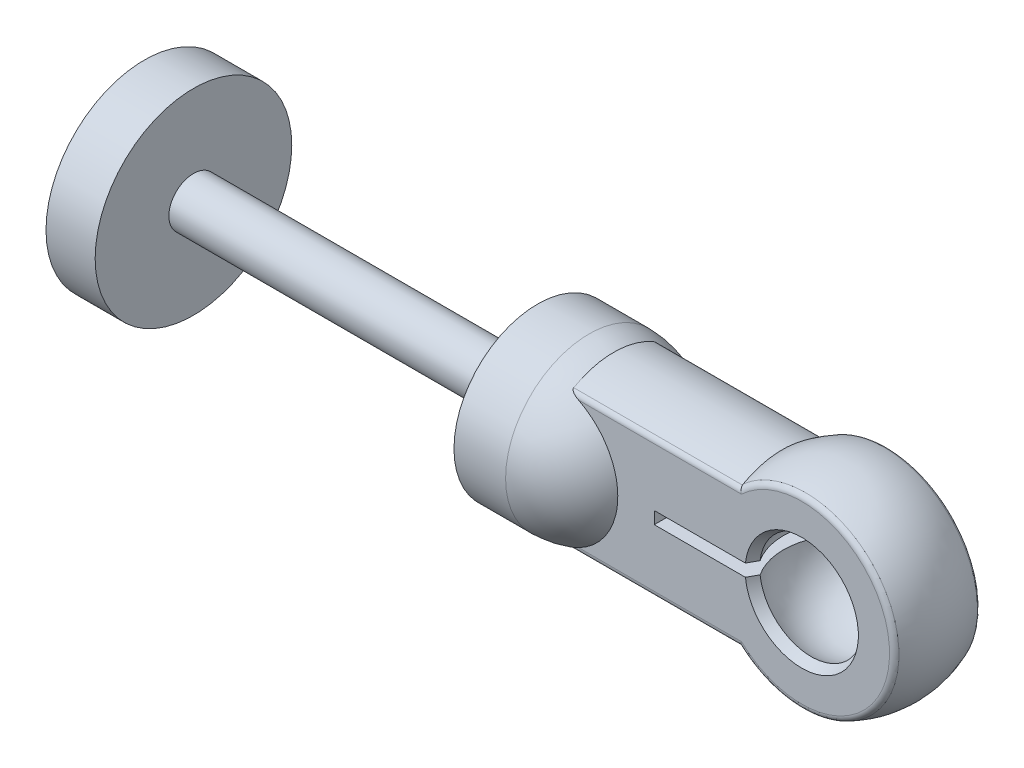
ISO-10303-21;
HEADER;
FILE_DESCRIPTION(('STEP AP214'),'2;1');
FILE_NAME('part.step','',(''),(''),'','','');
FILE_SCHEMA(('AUTOMOTIVE_DESIGN { 1 0 10303 214 1 1 1 1 }'));
ENDSEC;
DATA;
#1=APPLICATION_CONTEXT('core data for automotive mechanical design processes');
#2=APPLICATION_PROTOCOL_DEFINITION('international standard','automotive_design',2000,#1);
#3=PRODUCT_CONTEXT('',#1,'mechanical');
#4=PRODUCT('Part','Part','',(#3));
#5=PRODUCT_RELATED_PRODUCT_CATEGORY('part','',(#4));
#6=PRODUCT_DEFINITION_FORMATION('','',#4);
#7=PRODUCT_DEFINITION_CONTEXT('part definition',#1,'design');
#8=PRODUCT_DEFINITION('design','',#6,#7);
#9=PRODUCT_DEFINITION_SHAPE('','',#8);
#10=(LENGTH_UNIT() NAMED_UNIT(*) SI_UNIT(.MILLI.,.METRE.));
#11=(NAMED_UNIT(*) PLANE_ANGLE_UNIT() SI_UNIT($,.RADIAN.));
#12=(NAMED_UNIT(*) SI_UNIT($,.STERADIAN.) SOLID_ANGLE_UNIT());
#13=UNCERTAINTY_MEASURE_WITH_UNIT(LENGTH_MEASURE(1.E-05),#10,'distance_accuracy_value','');
#14=(GEOMETRIC_REPRESENTATION_CONTEXT(3) GLOBAL_UNCERTAINTY_ASSIGNED_CONTEXT((#13)) GLOBAL_UNIT_ASSIGNED_CONTEXT((#10,
#11,#12)) REPRESENTATION_CONTEXT('',''));
#15=CARTESIAN_POINT('',(0.,0.,0.));
#16=DIRECTION('',(0.,0.,1.));
#17=DIRECTION('',(1.,0.,0.));
#18=AXIS2_PLACEMENT_3D('',#15,#16,#17);
#19=CARTESIAN_POINT('',(-12.,0.5,-9.9));
#20=DIRECTION('',(-1.,0.,0.));
#21=DIRECTION('',(0.,0.,1.));
#22=AXIS2_PLACEMENT_3D('',#19,#20,#21);
#23=PLANE('',#22);
#24=DIRECTION('',(0.,1.,0.));
#25=VECTOR('',#24,1.);
#26=CARTESIAN_POINT('',(-12.,0.5,3.5));
#27=LINE('',#26,#25);
#28=CARTESIAN_POINT('',(-12.,-0.499999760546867,3.5));
#29=VERTEX_POINT('',#28);
#30=CARTESIAN_POINT('',(-12.,0.499999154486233,3.5));
#31=VERTEX_POINT('',#30);
#32=EDGE_CURVE('E364',#29,#31,#27,.T.);
#33=ORIENTED_EDGE('',*,*,#32,.F.);
#34=DIRECTION('',(0.,0.,-1.));
#35=VECTOR('',#34,1.);
#36=CARTESIAN_POINT('',(-12.,-0.5,-9.9));
#37=LINE('',#36,#35);
#38=CARTESIAN_POINT('',(-12.,-0.499999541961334,-3.5));
#39=VERTEX_POINT('',#38);
#40=EDGE_CURVE('E179',#29,#39,#37,.T.);
#41=ORIENTED_EDGE('',*,*,#40,.T.);
#42=DIRECTION('',(0.,1.,0.));
#43=VECTOR('',#42,1.);
#44=CARTESIAN_POINT('',(-12.,0.5,-3.5));
#45=LINE('',#44,#43);
#46=CARTESIAN_POINT('',(-12.,0.499999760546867,-3.5));
#47=VERTEX_POINT('',#46);
#48=EDGE_CURVE('E678',#47,#39,#45,.F.);
#49=ORIENTED_EDGE('',*,*,#48,.F.);
#50=DIRECTION('',(0.,0.,1.));
#51=VECTOR('',#50,1.);
#52=CARTESIAN_POINT('',(-12.,0.5,-9.9));
#53=LINE('',#52,#51);
#54=EDGE_CURVE('E372',#47,#31,#53,.T.);
#55=ORIENTED_EDGE('',*,*,#54,.T.);
#56=EDGE_LOOP('',(#33,#41,#49,#55));
#57=FACE_BOUND('',#56,.T.);
#58=ADVANCED_FACE('F15',(#57),#23,.F.);
#59=CARTESIAN_POINT('',(0.,0.,0.));
#60=DIRECTION('',(0.,1.,0.));
#61=DIRECTION('',(0.,0.,-1.));
#62=AXIS2_PLACEMENT_3D('',#59,#60,#61);
#63=SPHERICAL_SURFACE('',#62,5.);
#64=CARTESIAN_POINT('',(0.,-5.,0.));
#65=VERTEX_POINT('',#64);
#66=VERTEX_LOOP('',#65);
#67=FACE_BOUND('',#66,.T.);
#68=CARTESIAN_POINT('',(0.,5.,0.));
#69=CARTESIAN_POINT('',(-0.0383164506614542,5.00000010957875,0.));
#70=CARTESIAN_POINT('',(-0.0766330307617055,4.99955957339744,0.));
#71=CARTESIAN_POINT('',(-0.162806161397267,4.99757802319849,0.));
#72=CARTESIAN_POINT('',(-0.210657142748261,4.99578981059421,0.));
#73=CARTESIAN_POINT('',(-0.32540872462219,4.98984988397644,0.));
#74=CARTESIAN_POINT('',(-0.39227564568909,4.98503901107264,0.));
#75=CARTESIAN_POINT('',(-0.544831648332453,4.97097403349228,0.));
#76=CARTESIAN_POINT('',(-0.630441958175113,4.96084333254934,0.));
#77=CARTESIAN_POINT('',(-0.765476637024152,4.9413129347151,0.));
#78=CARTESIAN_POINT('',(-0.815116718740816,4.93336720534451,0.));
#79=CARTESIAN_POINT('',(-0.918850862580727,4.91515447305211,0.));
#80=CARTESIAN_POINT('',(-0.972918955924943,4.90473848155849,0.));
#81=CARTESIAN_POINT('',(-1.08536598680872,4.88114349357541,0.));
#82=CARTESIAN_POINT('',(-1.14371103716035,4.86780301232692,0.));
#83=CARTESIAN_POINT('',(-1.26453127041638,4.83788562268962,0.));
#84=CARTESIAN_POINT('',(-1.32696354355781,4.82113519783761,0.));
#85=CARTESIAN_POINT('',(-1.45573012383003,4.78389675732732,0.));
#86=CARTESIAN_POINT('',(-1.52201099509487,4.7632238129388,0.));
#87=CARTESIAN_POINT('',(-1.6581935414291,4.71761591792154,0.));
#88=CARTESIAN_POINT('',(-1.72802976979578,4.6924853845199,0.));
#89=CARTESIAN_POINT('',(-1.87098133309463,4.63742040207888,0.));
#90=CARTESIAN_POINT('',(-1.94401763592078,4.60728065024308,0.));
#91=CARTESIAN_POINT('',(-2.09296092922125,4.54164425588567,0.));
#92=CARTESIAN_POINT('',(-2.16877373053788,4.50593368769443,0.));
#93=CARTESIAN_POINT('',(-2.32278597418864,4.42860124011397,0.));
#94=CARTESIAN_POINT('',(-2.40087434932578,4.38675820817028,0.));
#95=CARTESIAN_POINT('',(-2.55888068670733,4.29660823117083,0.));
#96=CARTESIAN_POINT('',(-2.63866949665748,4.24807417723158,0.));
#97=CARTESIAN_POINT('',(-2.75771899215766,4.17101144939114,0.));
#98=CARTESIAN_POINT('',(-2.7980237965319,4.14408162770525,0.));
#99=CARTESIAN_POINT('',(-2.87881987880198,4.08838138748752,0.));
#100=CARTESIAN_POINT('',(-2.91929119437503,4.05958194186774,0.));
#101=CARTESIAN_POINT('',(-3.00032199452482,4.00008189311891,0.));
#102=CARTESIAN_POINT('',(-3.04086011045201,3.96935220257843,0.));
#103=CARTESIAN_POINT('',(-3.12192243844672,3.90593272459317,0.));
#104=CARTESIAN_POINT('',(-3.16242388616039,3.8732138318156,0.));
#105=CARTESIAN_POINT('',(-3.24330419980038,3.80576065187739,0.));
#106=CARTESIAN_POINT('',(-3.28365885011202,3.77099732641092,0.));
#107=CARTESIAN_POINT('',(-3.36413100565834,3.69940369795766,0.));
#108=CARTESIAN_POINT('',(-3.4042228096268,3.66254450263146,0.));
#109=CARTESIAN_POINT('',(-3.48404859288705,3.58671190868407,0.));
#110=CARTESIAN_POINT('',(-3.52375534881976,3.5477098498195,0.));
#111=CARTESIAN_POINT('',(-3.60268431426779,3.46754917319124,0.));
#112=CARTESIAN_POINT('',(-3.6418777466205,3.42636221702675,0.));
#113=CARTESIAN_POINT('',(-3.71964733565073,3.34179483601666,0.));
#114=CARTESIAN_POINT('',(-3.7581931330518,3.29838648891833,0.));
#115=CARTESIAN_POINT('',(-3.83452881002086,3.20934544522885,0.));
#116=CARTESIAN_POINT('',(-3.87228672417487,3.16368534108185,0.));
#117=CARTESIAN_POINT('',(-3.94690221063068,3.07011653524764,0.));
#118=CARTESIAN_POINT('',(-3.98372619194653,3.02218104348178,0.));
#119=CARTESIAN_POINT('',(-4.05632378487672,2.92404446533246,0.));
#120=CARTESIAN_POINT('',(-4.09206216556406,2.87381731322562,0.));
#121=CARTESIAN_POINT('',(-4.16233315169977,2.77108829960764,0.));
#122=CARTESIAN_POINT('',(-4.19682887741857,2.71856120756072,0.));
#123=CARTESIAN_POINT('',(-4.26445404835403,2.61123172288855,0.));
#124=CARTESIAN_POINT('',(-4.29754496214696,2.55640504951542,0.));
#125=CARTESIAN_POINT('',(-4.36219523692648,2.44448498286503,0.));
#126=CARTESIAN_POINT('',(-4.39371441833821,2.38736837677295,0.));
#127=CARTESIAN_POINT('',(-4.45505157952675,2.27088684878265,0.));
#128=CARTESIAN_POINT('',(-4.48482774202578,2.21149990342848,0.));
#129=CARTESIAN_POINT('',(-4.54250529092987,2.0905065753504,0.));
#130=CARTESIAN_POINT('',(-4.57036324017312,2.0288794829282,0.));
#131=CARTESIAN_POINT('',(-4.62402737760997,1.9034458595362,0.));
#132=CARTESIAN_POINT('',(-4.64978853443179,1.83962005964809,0.));
#133=CARTESIAN_POINT('',(-4.69907926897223,1.70984077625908,0.));
#134=CARTESIAN_POINT('',(-4.72256225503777,1.64386959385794,0.));
#135=CARTESIAN_POINT('',(-4.76711465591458,1.50986367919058,0.));
#136=CARTESIAN_POINT('',(-4.78813596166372,1.44181294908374,0.));
#137=CARTESIAN_POINT('',(-4.82758151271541,1.3037250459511,0.));
#138=CARTESIAN_POINT('',(-4.84595618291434,1.23367370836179,0.));
#139=CARTESIAN_POINT('',(-4.87992442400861,1.09167526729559,0.));
#140=CARTESIAN_POINT('',(-4.89546701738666,1.01971596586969,0.));
#141=CARTESIAN_POINT('',(-4.92358677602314,0.874006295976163,0.));
#142=CARTESIAN_POINT('',(-4.93611162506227,0.800245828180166,0.));
#143=CARTESIAN_POINT('',(-4.95801451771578,0.651053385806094,0.));
#144=CARTESIAN_POINT('',(-4.96733901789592,0.575613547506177,0.));
#145=CARTESIAN_POINT('',(-4.9749371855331,0.50000000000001,0.));
#146=B_SPLINE_CURVE_WITH_KNOTS('',3,(#68,#69,#70,#71,#72,#73,#74,#75,#76,#77,#78,#79,#80,#81,
#82,#83,#84,#85,#86,#87,#88,#89,#90,#91,#92,#93,#94,#95,#96,#97,#98,#99,#100,#101,#102,#103,
#104,#105,#106,#107,#108,#109,#110,#111,#112,#113,#114,#115,#116,#117,#118,#119,#120,#121,#122,
#123,#124,#125,#126,#127,#128,#129,#130,#131,#132,#133,#134,#135,#136,#137,#138,#139,#140,#141,
#142,#143,#144,#145),.UNSPECIFIED.,.F.,.F.,(4,2,2,2,2,2,2,2,2,2,2,2,2,2,2,2,2,2,2,2,2,2,2,2,2,2,
2,2,2,2,2,2,2,2,2,2,2,2,4),(0.,0.11494728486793,0.258580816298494,0.459648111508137,
0.71814253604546,0.868939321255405,1.03409490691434,1.21360895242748,1.40748108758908,
1.61571091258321,1.83829799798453,2.07524188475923,2.32654208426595,2.59219807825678,
2.87220931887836,3.0176133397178,3.16660712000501,3.31919064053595,3.47536388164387,
3.63512682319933,3.79847944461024,3.9654217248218,4.13595364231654,4.31007517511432,
4.48778630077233,4.6690869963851,4.85397723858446,5.04245700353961,5.23452626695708,
5.43018500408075,5.62943318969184,5.83227079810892,6.03869780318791,6.2487141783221,
6.46231989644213,6.67951493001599,6.90029925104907,7.12467283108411,7.35263564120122),.UNSPECIFIED.);
#147=CARTESIAN_POINT('',(0.,5.,0.));
#148=VERTEX_POINT('',#147);
#149=CARTESIAN_POINT('',(-4.97493718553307,0.500000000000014,-3.35379872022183E-13));
#150=VERTEX_POINT('',#149);
#151=EDGE_CURVE('E341',#148,#150,#146,.T.);
#152=ORIENTED_EDGE('',*,*,#151,.F.);
#153=ORIENTED_EDGE('',*,*,#151,.T.);
#154=CARTESIAN_POINT('',(0.,0.5,0.));
#155=DIRECTION('',(0.,1.,0.));
#156=DIRECTION('',(0.,0.,1.));
#157=AXIS2_PLACEMENT_3D('',#154,#155,#156);
#158=CIRCLE('',#157,4.9749371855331);
#159=CARTESIAN_POINT('',(-4.1607347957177,0.499998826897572,-2.72732233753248));
#160=VERTEX_POINT('',#159);
#161=EDGE_CURVE('E361',#150,#160,#158,.F.);
#162=ORIENTED_EDGE('',*,*,#161,.T.);
#163=CARTESIAN_POINT('',(-4.16073493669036,0.499997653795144,-2.72732233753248));
#164=CARTESIAN_POINT('',(-4.14634944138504,0.61982368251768,-2.72732233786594));
#165=CARTESIAN_POINT('',(-4.12676084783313,0.739022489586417,-2.7273223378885));
#166=CARTESIAN_POINT('',(-4.07738452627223,0.975284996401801,-2.72732233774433));
#167=CARTESIAN_POINT('',(-4.04759712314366,1.09234876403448,-2.72732233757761));
#168=CARTESIAN_POINT('',(-3.9780609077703,1.32336327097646,-2.7273223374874));
#169=CARTESIAN_POINT('',(-3.93832117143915,1.4373167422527,-2.7273223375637));
#170=CARTESIAN_POINT('',(-3.84916807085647,1.66137052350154,-2.72732233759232));
#171=CARTESIAN_POINT('',(-3.79975505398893,1.77147097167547,-2.72732233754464));
#172=CARTESIAN_POINT('',(-3.69285718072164,1.98454032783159,-2.7273223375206));
#173=CARTESIAN_POINT('',(-3.63558228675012,2.08761464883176,-2.72732233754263));
#174=CARTESIAN_POINT('',(-3.51253065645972,2.28860893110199,-2.72732233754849));
#175=CARTESIAN_POINT('',(-3.44675087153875,2.38652702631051,-2.72732233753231));
#176=CARTESIAN_POINT('',(-3.30722027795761,2.57640811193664,-2.72732233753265));
#177=CARTESIAN_POINT('',(-3.23347480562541,2.66837502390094,-2.72732233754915));
#178=CARTESIAN_POINT('',(-3.07847392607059,2.84580258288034,-2.72732233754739));
#179=CARTESIAN_POINT('',(-2.99721592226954,2.93126096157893,-2.7273223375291));
#180=CARTESIAN_POINT('',(-2.82781304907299,3.09500562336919,-2.72732233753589));
#181=CARTESIAN_POINT('',(-2.73967010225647,3.17329389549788,-2.72732233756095));
#182=CARTESIAN_POINT('',(-2.55710390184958,3.32216887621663,-2.72732233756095));
#183=CARTESIAN_POINT('',(-2.46268064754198,3.39275558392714,-2.72732233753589));
#184=CARTESIAN_POINT('',(-2.26815697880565,3.52577220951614,-2.72732233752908));
#185=CARTESIAN_POINT('',(-2.16805265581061,3.58819641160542,-2.72732233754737));
#186=CARTESIAN_POINT('',(-1.96297479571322,3.70436580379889,-2.72732233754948));
#187=CARTESIAN_POINT('',(-1.85800296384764,3.75811400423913,-2.72732233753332));
#188=CARTESIAN_POINT('',(-1.6438011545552,3.85662298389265,-2.72732233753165));
#189=CARTESIAN_POINT('',(-1.53456716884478,3.90137504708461,-2.72732233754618));
#190=CARTESIAN_POINT('',(-1.31275514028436,3.98149290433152,-2.72732233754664));
#191=CARTESIAN_POINT('',(-1.20017837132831,4.01686222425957,-2.7273223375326));
#192=CARTESIAN_POINT('',(-0.972593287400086,4.07794566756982,-2.72732233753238));
#193=CARTESIAN_POINT('',(-0.857588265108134,4.10367207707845,-2.72732233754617));
#194=CARTESIAN_POINT('',(-0.625867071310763,4.14534069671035,-2.72732233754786));
#195=CARTESIAN_POINT('',(-0.509151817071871,4.16128796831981,-2.72732233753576));
#196=CARTESIAN_POINT('',(-0.326801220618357,4.17842138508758,-2.72732233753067));
#197=CARTESIAN_POINT('',(-0.261468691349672,4.18301738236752,-2.72732233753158));
#198=CARTESIAN_POINT('',(-0.130759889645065,4.18913934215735,-2.7273223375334));
#199=CARTESIAN_POINT('',(-0.0653838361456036,4.19066997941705,-2.72732233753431));
#200=CARTESIAN_POINT('',(0.,4.19066973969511,-2.72732233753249));
#201=B_SPLINE_CURVE_WITH_KNOTS('',3,(#163,#164,#165,#166,#167,#168,#169,#170,#171,#172,#173,
#174,#175,#176,#177,#178,#179,#180,#181,#182,#183,#184,#185,#186,#187,#188,#189,#190,#191,#192,
#193,#194,#195,#196,#197,#198,#199,#200),.UNSPECIFIED.,.F.,.F.,(4,2,2,2,2,2,2,2,2,2,2,2,2,2,2,2,
2,2,4),(0.,0.361943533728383,0.723875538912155,1.08547867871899,1.4470688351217,
1.80040641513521,2.15387100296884,2.50710025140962,2.86045204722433,3.2137055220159,
3.56695903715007,3.92045860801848,4.27383525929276,4.62755265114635,4.98113693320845,
5.33426916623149,5.68721847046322,5.88363631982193,6.07975439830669),.UNSPECIFIED.);
#202=CARTESIAN_POINT('',(0.,4.19066973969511,-2.72732233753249));
#203=VERTEX_POINT('',#202);
#204=EDGE_CURVE('E855',#160,#203,#201,.T.);
#205=ORIENTED_EDGE('',*,*,#204,.T.);
#206=CARTESIAN_POINT('',(0.,0.,-2.72732233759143));
#207=DIRECTION('',(0.,0.,-1.));
#208=DIRECTION('',(-1.,0.,0.));
#209=AXIS2_PLACEMENT_3D('',#206,#207,#208);
#210=CIRCLE('',#209,4.19066973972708);
#211=CARTESIAN_POINT('',(0.,-4.19066973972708,-2.72732233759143));
#212=VERTEX_POINT('',#211);
#213=EDGE_CURVE('E854',#203,#212,#210,.T.);
#214=ORIENTED_EDGE('',*,*,#213,.T.);
#215=CARTESIAN_POINT('',(0.,-4.19066973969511,-2.72732233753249));
#216=CARTESIAN_POINT('',(-0.120686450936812,-4.19068369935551,-2.72732233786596));
#217=CARTESIAN_POINT('',(-0.241370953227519,-4.1854568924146,-2.72732233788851));
#218=CARTESIAN_POINT('',(-0.481836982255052,-4.16462225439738,-2.72732233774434));
#219=CARTESIAN_POINT('',(-0.601618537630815,-4.14901475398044,-2.72732233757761));
#220=CARTESIAN_POINT('',(-0.839279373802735,-4.10753807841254,-2.72732233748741));
#221=CARTESIAN_POINT('',(-0.957160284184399,-4.08167824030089,-2.72732233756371));
#222=CARTESIAN_POINT('',(-1.19025064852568,-4.0198943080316,-2.72732233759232));
#223=CARTESIAN_POINT('',(-1.30546019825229,-3.98397057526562,-2.72732233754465));
#224=CARTESIAN_POINT('',(-1.52976176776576,-3.90325804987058,-2.72732233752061));
#225=CARTESIAN_POINT('',(-1.63893339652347,-3.85869029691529,-2.72732233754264));
#226=CARTESIAN_POINT('',(-1.85317348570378,-3.76049870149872,-2.7273223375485));
#227=CARTESIAN_POINT('',(-1.95824045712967,-3.7068716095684,-2.72732233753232));
#228=CARTESIAN_POINT('',(-2.16341287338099,-3.59099282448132,-2.72732233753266));
#229=CARTESIAN_POINT('',(-2.26352157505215,-3.52874689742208,-2.72732233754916));
#230=CARTESIAN_POINT('',(-2.45817521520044,-3.39602247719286,-2.72732233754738));
#231=CARTESIAN_POINT('',(-2.55271821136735,-3.3255411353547,-2.72732233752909));
#232=CARTESIAN_POINT('',(-2.73550502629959,-3.1768850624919,-2.72732233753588));
#233=CARTESIAN_POINT('',(-2.82375059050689,-3.09871247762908,-2.72732233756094));
#234=CARTESIAN_POINT('',(-2.99334448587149,-2.9352129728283,-2.72732233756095));
#235=CARTESIAN_POINT('',(-3.07469281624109,-2.84988605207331,-2.72732233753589));
#236=CARTESIAN_POINT('',(-3.22996830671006,-2.67262239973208,-2.72732233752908));
#237=CARTESIAN_POINT('',(-3.30389025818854,-2.58068110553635,-2.72732233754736));
#238=CARTESIAN_POINT('',(-3.44369810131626,-2.39092857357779,-2.72732233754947));
#239=CARTESIAN_POINT('',(-3.5095867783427,-2.29311938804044,-2.72732233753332));
#240=CARTESIAN_POINT('',(-3.63294895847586,-2.09220098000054,-2.72732233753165));
#241=CARTESIAN_POINT('',(-3.69041428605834,-1.9890867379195,-2.72732233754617));
#242=CARTESIAN_POINT('',(-3.79642470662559,-1.77841818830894,-2.72732233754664));
#243=CARTESIAN_POINT('',(-3.84497314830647,-1.67086556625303,-2.72732233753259));
#244=CARTESIAN_POINT('',(-3.9327739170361,-1.45219416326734,-2.72732233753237));
#245=CARTESIAN_POINT('',(-3.97203804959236,-1.34108011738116,-2.72732233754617));
#246=CARTESIAN_POINT('',(-4.04105616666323,-1.11598572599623,-2.72732233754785));
#247=CARTESIAN_POINT('',(-4.0708150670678,-1.00200689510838,-2.72732233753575));
#248=CARTESIAN_POINT('',(-4.10958273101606,-0.823003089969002,-2.72732233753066));
#249=CARTESIAN_POINT('',(-4.12194086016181,-0.758685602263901,-2.72732233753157));
#250=CARTESIAN_POINT('',(-4.14361423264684,-0.629640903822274,-2.72732233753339));
#251=CARTESIAN_POINT('',(-4.15293409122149,-0.564914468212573,-2.7273223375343));
#252=CARTESIAN_POINT('',(-4.16073493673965,-0.499997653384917,-2.72732233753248));
#253=B_SPLINE_CURVE_WITH_KNOTS('',3,(#215,#216,#217,#218,#219,#220,#221,#222,#223,#224,#225,
#226,#227,#228,#229,#230,#231,#232,#233,#234,#235,#236,#237,#238,#239,#240,#241,#242,#243,#244,
#245,#246,#247,#248,#249,#250,#251,#252),.UNSPECIFIED.,.F.,.F.,(4,2,2,2,2,2,2,2,2,2,2,2,2,2,2,2,
2,2,4),(0.,0.361943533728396,0.72387553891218,1.085478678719,1.4470688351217,1.8004064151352,
2.1538710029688,2.50710025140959,2.86045204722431,3.21370552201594,3.56695903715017,
3.92045860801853,4.27383525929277,4.62755265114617,4.98113693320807,5.33426916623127,
5.68721847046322,5.88363632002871,6.07975439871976),.UNSPECIFIED.);
#254=CARTESIAN_POINT('',(-4.16073479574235,-0.499998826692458,-2.72732233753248));
#255=VERTEX_POINT('',#254);
#256=EDGE_CURVE('E471',#212,#255,#253,.T.);
#257=ORIENTED_EDGE('',*,*,#256,.T.);
#258=CARTESIAN_POINT('',(0.,-0.499999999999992,0.));
#259=DIRECTION('',(0.,1.,0.));
#260=DIRECTION('',(0.,0.,1.));
#261=AXIS2_PLACEMENT_3D('',#258,#259,#260);
#262=CIRCLE('',#261,4.9749371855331);
#263=CARTESIAN_POINT('',(-4.16073482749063,-0.499999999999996,2.72732232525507));
#264=VERTEX_POINT('',#263);
#265=EDGE_CURVE('E371',#255,#264,#262,.T.);
#266=ORIENTED_EDGE('',*,*,#265,.T.);
#267=CARTESIAN_POINT('',(0.,0.,2.72732233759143));
#268=DIRECTION('',(0.,0.,1.));
#269=DIRECTION('',(1.,0.,0.));
#270=AXIS2_PLACEMENT_3D('',#267,#268,#269);
#271=CIRCLE('',#270,4.19066973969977);
#272=CARTESIAN_POINT('',(-4.16073643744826,0.499999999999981,2.72731961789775));
#273=VERTEX_POINT('',#272);
#274=EDGE_CURVE('E368',#264,#273,#271,.T.);
#275=ORIENTED_EDGE('',*,*,#274,.T.);
#276=CARTESIAN_POINT('',(0.,0.499999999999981,0.));
#277=DIRECTION('',(0.,1.,0.));
#278=DIRECTION('',(0.,0.,1.));
#279=AXIS2_PLACEMENT_3D('',#276,#277,#278);
#280=CIRCLE('',#279,4.9749371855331);
#281=EDGE_CURVE('E366',#273,#150,#280,.F.);
#282=ORIENTED_EDGE('',*,*,#281,.T.);
#283=EDGE_LOOP('',(#152,#153,#162,#205,#214,#257,#266,#275,#282));
#284=FACE_BOUND('',#283,.T.);
#285=ADVANCED_FACE('F359',(#67,#284),#63,.F.);
#286=CARTESIAN_POINT('',(0.,0.,-3.));
#287=DIRECTION('',(0.,0.,1.));
#288=DIRECTION('',(0.998982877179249,0.0450911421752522,0.));
#289=AXIS2_PLACEMENT_3D('',#286,#287,#288);
#290=TOROIDAL_SURFACE('',#289,7.145802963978,0.5);
#291=CARTESIAN_POINT('',(0.,0.,-3.19354838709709));
#292=DIRECTION('',(0.,0.,1.));
#293=DIRECTION('',(0.998982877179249,0.0450911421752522,0.));
#294=AXIS2_PLACEMENT_3D('',#291,#292,#293);
#295=CIRCLE('',#294,7.60682251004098);
#296=CARTESIAN_POINT('',(-5.080600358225,-5.66138222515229,-3.193548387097));
#297=VERTEX_POINT('',#296);
#298=CARTESIAN_POINT('',(-5.080600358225,5.66138222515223,-3.1935483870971));
#299=VERTEX_POINT('',#298);
#300=EDGE_CURVE('E155',#297,#299,#295,.T.);
#301=ORIENTED_EDGE('',*,*,#300,.F.);
#302=CARTESIAN_POINT('',(-5.074539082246,-5.62916512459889,-3.24999999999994));
#303=CARTESIAN_POINT('',(-5.0750449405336,-5.63048183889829,-3.24771938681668));
#304=CARTESIAN_POINT('',(-5.0755183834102,-5.63180026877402,-3.24543259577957));
#305=CARTESIAN_POINT('',(-5.07640235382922,-5.63444413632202,-3.24084037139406));
#306=CARTESIAN_POINT('',(-5.07681266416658,-5.63576958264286,-3.23853490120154));
#307=CARTESIAN_POINT('',(-5.07757037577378,-5.6384274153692,-3.2339052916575));
#308=CARTESIAN_POINT('',(-5.07791752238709,-5.63975980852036,-3.23158111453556));
#309=CARTESIAN_POINT('',(-5.07854895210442,-5.64243147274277,-3.22691405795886));
#310=CARTESIAN_POINT('',(-5.0788329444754,-5.64377074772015,-3.224571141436));
#311=CARTESIAN_POINT('',(-5.07933809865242,-5.64645611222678,-3.21986657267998));
#312=CARTESIAN_POINT('',(-5.07955893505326,-5.64780220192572,-3.21750488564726));
#313=CARTESIAN_POINT('',(-5.07993781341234,-5.65050113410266,-3.21276273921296));
#314=CARTESIAN_POINT('',(-5.0800954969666,-5.65185397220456,-3.2103822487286));
#315=CARTESIAN_POINT('',(-5.08034809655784,-5.65456633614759,-3.2056024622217));
#316=CARTESIAN_POINT('',(-5.08044262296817,-5.65592585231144,-3.2032031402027));
#317=CARTESIAN_POINT('',(-5.08056895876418,-5.65865152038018,-3.19838563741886));
#318=CARTESIAN_POINT('',(-5.08060034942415,-5.6600176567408,-3.19596743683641));
#319=CARTESIAN_POINT('',(-5.080600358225,-5.66138222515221,-3.19354838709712));
#320=B_SPLINE_CURVE_WITH_KNOTS('',3,(#302,#303,#304,#305,#306,#307,#308,#309,#310,#311,#312,
#313,#314,#315,#316,#317,#318,#319),.UNSPECIFIED.,.F.,.F.,(4,2,2,2,2,2,2,2,4),(0.,
0.00804448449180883,0.0161160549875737,0.024219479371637,0.0323594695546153,0.040540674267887,
0.0487676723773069,0.0570449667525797,0.0653769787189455),.UNSPECIFIED.);
#321=CARTESIAN_POINT('',(-5.07453908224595,-5.62916512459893,-3.24999999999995));
#322=VERTEX_POINT('',#321);
#323=EDGE_CURVE('E338',#297,#322,#320,.F.);
#324=ORIENTED_EDGE('',*,*,#323,.T.);
#325=CARTESIAN_POINT('',(-5.07453908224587,-5.62916512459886,-3.24999999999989));
#326=CARTESIAN_POINT('',(-5.07356505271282,-5.62662964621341,-3.25439150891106));
#327=CARTESIAN_POINT('',(-5.07256670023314,-5.62402921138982,-3.25874007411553));
#328=CARTESIAN_POINT('',(-5.07051164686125,-5.61867491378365,-3.26739179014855));
#329=CARTESIAN_POINT('',(-5.06945445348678,-5.61591975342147,-3.27169402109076));
#330=CARTESIAN_POINT('',(-5.06728092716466,-5.61025572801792,-3.28024699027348));
#331=CARTESIAN_POINT('',(-5.06616410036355,-5.60734558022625,-3.28449675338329));
#332=CARTESIAN_POINT('',(-5.06387067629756,-5.60137148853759,-3.29293862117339));
#333=CARTESIAN_POINT('',(-5.06269358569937,-5.59830627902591,-3.29712969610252));
#334=CARTESIAN_POINT('',(-5.0602791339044,-5.59202215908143,-3.30544788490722));
#335=CARTESIAN_POINT('',(-5.05904128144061,-5.5888020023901,-3.30957391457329));
#336=CARTESIAN_POINT('',(-5.05650495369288,-5.58220827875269,-3.31775559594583));
#337=CARTESIAN_POINT('',(-5.05520599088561,-5.5788334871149,-3.32181010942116));
#338=CARTESIAN_POINT('',(-5.05254724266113,-5.57193098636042,-3.32984223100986));
#339=CARTESIAN_POINT('',(-5.05118697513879,-5.56840207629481,-3.33381864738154));
#340=CARTESIAN_POINT('',(-5.04840557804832,-5.56119204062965,-3.34168794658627));
#341=CARTESIAN_POINT('',(-5.04698397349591,-5.55750973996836,-3.34557958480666));
#342=CARTESIAN_POINT('',(-5.04408003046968,-5.5499938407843,-3.35327260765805));
#343=CARTESIAN_POINT('',(-5.04259722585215,-5.54615909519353,-3.35707269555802));
#344=CARTESIAN_POINT('',(-5.03957118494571,-5.53833944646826,-3.36457581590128));
#345=CARTESIAN_POINT('',(-5.03802749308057,-5.53435342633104,-3.36827750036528));
#346=CARTESIAN_POINT('',(-5.03488016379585,-5.52623259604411,-3.37557694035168));
#347=CARTESIAN_POINT('',(-5.03327608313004,-5.52209670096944,-3.37917329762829));
#348=CARTESIAN_POINT('',(-5.03000864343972,-5.51367772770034,-3.38625515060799));
#349=CARTESIAN_POINT('',(-5.02834485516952,-5.5093935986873,-3.38973919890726));
#350=CARTESIAN_POINT('',(-5.02495889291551,-5.50067998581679,-3.39658944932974));
#351=CARTESIAN_POINT('',(-5.02323630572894,-5.49624948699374,-3.39995415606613));
#352=CARTESIAN_POINT('',(-5.01973372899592,-5.48724527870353,-3.40655871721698));
#353=CARTESIAN_POINT('',(-5.01795334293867,-5.4826705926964,-3.40979702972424));
#354=CARTESIAN_POINT('',(-5.01433678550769,-5.47338013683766,-3.41614172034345));
#355=CARTESIAN_POINT('',(-5.01250024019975,-5.46866342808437,-3.41924651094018));
#356=CARTESIAN_POINT('',(-5.00877159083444,-5.45909232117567,-3.42531726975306));
#357=CARTESIAN_POINT('',(-5.00687912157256,-5.45423703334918,-3.42828160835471));
#358=CARTESIAN_POINT('',(-5.00194882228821,-5.44157239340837,-3.43571725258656));
#359=CARTESIAN_POINT('',(-4.99888779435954,-5.43369444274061,-3.44005715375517));
#360=CARTESIAN_POINT('',(-4.9924750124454,-5.41718158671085,-3.44858121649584));
#361=CARTESIAN_POINT('',(-4.98911788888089,-5.40853225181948,-3.45273330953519));
#362=CARTESIAN_POINT('',(-4.9820943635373,-5.39046719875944,-3.46077920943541));
#363=CARTESIAN_POINT('',(-4.97842207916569,-5.38103831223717,-3.46463845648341));
#364=CARTESIAN_POINT('',(-4.97276048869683,-5.36653876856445,-3.47006682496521));
#365=CARTESIAN_POINT('',(-4.97080390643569,-5.36153446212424,-3.47185028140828));
#366=CARTESIAN_POINT('',(-4.96680965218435,-5.35133285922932,-3.47530500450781));
#367=CARTESIAN_POINT('',(-4.96477128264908,-5.34613420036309,-3.47697146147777));
#368=CARTESIAN_POINT('',(-4.96061339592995,-5.33554536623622,-3.48017659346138));
#369=CARTESIAN_POINT('',(-4.95849321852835,-5.33015394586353,-3.48171029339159));
#370=CARTESIAN_POINT('',(-4.95417211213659,-5.31918144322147,-3.48463396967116));
#371=CARTESIAN_POINT('',(-4.95197056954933,-5.31359923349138,-3.48601881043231));
#372=CARTESIAN_POINT('',(-4.94748777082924,-5.3022477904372,-3.48862835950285));
#373=CARTESIAN_POINT('',(-4.94520596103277,-5.29647755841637,-3.48984777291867));
#374=CARTESIAN_POINT('',(-4.94056432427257,-5.28475344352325,-3.49210967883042));
#375=CARTESIAN_POINT('',(-4.93820401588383,-5.27879869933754,-3.49314672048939));
#376=CARTESIAN_POINT('',(-4.93340780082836,-5.26670974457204,-3.49502675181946));
#377=CARTESIAN_POINT('',(-4.93097149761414,-5.2605748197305,-3.49586413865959));
#378=CARTESIAN_POINT('',(-4.92602649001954,-5.24813053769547,-3.49732745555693));
#379=CARTESIAN_POINT('',(-4.92351748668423,-5.24182062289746,-3.49794763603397));
#380=CARTESIAN_POINT('',(-4.9184310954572,-5.22903230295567,-3.49895889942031));
#381=CARTESIAN_POINT('',(-4.91585351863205,-5.22255350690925,-3.49934409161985));
#382=CARTESIAN_POINT('',(-4.91063492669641,-5.20943428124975,-3.49986768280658));
#383=CARTESIAN_POINT('',(-4.90799384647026,-5.20279363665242,-3.5000000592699));
#384=CARTESIAN_POINT('',(-4.905354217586,-5.196152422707,-3.5));
#385=B_SPLINE_CURVE_WITH_KNOTS('',3,(#325,#326,#327,#328,#329,#330,#331,#332,#333,#334,#335,
#336,#337,#338,#339,#340,#341,#342,#343,#344,#345,#346,#347,#348,#349,#350,#351,#352,#353,#354,
#355,#356,#357,#358,#359,#360,#361,#362,#363,#364,#365,#366,#367,#368,#369,#370,#371,#372,#373,
#374,#375,#376,#377,#378,#379,#380,#381,#382,#383,#384),.UNSPECIFIED.,.F.,.F.,(4,2,2,2,2,2,2,2,
2,2,2,2,2,2,2,2,2,2,2,2,2,2,2,2,2,2,2,2,2,4),(0.,0.0154900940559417,0.0311386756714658,
0.0469471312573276,0.0629167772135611,0.0790488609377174,0.0953445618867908,0.111804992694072,
0.128431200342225,0.145224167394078,0.162184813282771,0.179313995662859,0.19661251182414,
0.214081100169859,0.231720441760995,0.249531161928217,0.267513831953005,0.296002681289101,
0.326482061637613,0.358951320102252,0.375933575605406,0.393412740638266,0.411388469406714,
0.429860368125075,0.448827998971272,0.468290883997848,0.488248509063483,0.50870032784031,
0.529645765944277,0.551084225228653),.UNSPECIFIED.);
#386=CARTESIAN_POINT('',(-4.905354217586,-5.196152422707,-3.5));
#387=VERTEX_POINT('',#386);
#388=EDGE_CURVE('E567',#387,#322,#385,.F.);
#389=ORIENTED_EDGE('',*,*,#388,.F.);
#390=CARTESIAN_POINT('',(0.,0.,-3.5));
#391=DIRECTION('',(0.,0.,1.));
#392=DIRECTION('',(-0.686466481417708,-0.727161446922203,0.));
#393=AXIS2_PLACEMENT_3D('',#390,#391,#392);
#394=CIRCLE('',#393,7.14580296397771);
#395=CARTESIAN_POINT('',(7.13853480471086,0.322212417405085,-3.5));
#396=VERTEX_POINT('',#395);
#397=EDGE_CURVE('E320',#387,#396,#394,.T.);
#398=ORIENTED_EDGE('',*,*,#397,.T.);
#399=CARTESIAN_POINT('',(0.,0.,-3.5));
#400=DIRECTION('',(0.,0.,1.));
#401=DIRECTION('',(0.998982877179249,0.0450911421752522,0.));
#402=AXIS2_PLACEMENT_3D('',#399,#400,#401);
#403=CIRCLE('',#402,7.14580296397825);
#404=CARTESIAN_POINT('',(-4.90535421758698,5.19615242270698,-3.5));
#405=VERTEX_POINT('',#404);
#406=EDGE_CURVE('E296',#396,#405,#403,.T.);
#407=ORIENTED_EDGE('',*,*,#406,.T.);
#408=CARTESIAN_POINT('',(-4.905354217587,5.196152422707,-3.5));
#409=CARTESIAN_POINT('',(-4.90799261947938,5.20279054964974,-3.50000005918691));
#410=CARTESIAN_POINT('',(-4.91063249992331,5.20942809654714,-3.49986780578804));
#411=CARTESIAN_POINT('',(-4.91584905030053,5.22254186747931,-3.49934467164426));
#412=CARTESIAN_POINT('',(-4.91842578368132,5.22901830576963,-3.49895978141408));
#413=CARTESIAN_POINT('',(-4.92351084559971,5.2418026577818,-3.49794923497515));
#414=CARTESIAN_POINT('',(-4.92601936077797,5.24811096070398,-3.49732943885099));
#415=CARTESIAN_POINT('',(-4.93096374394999,5.26055276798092,-3.49586690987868));
#416=CARTESIAN_POINT('',(-4.93339990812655,5.26668682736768,-3.49502989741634));
#417=CARTESIAN_POINT('',(-4.93819618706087,5.27877479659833,-3.49315054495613));
#418=CARTESIAN_POINT('',(-4.94055669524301,5.28472941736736,-3.49211378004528));
#419=CARTESIAN_POINT('',(-4.94519905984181,5.29645402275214,-3.48985227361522));
#420=CARTESIAN_POINT('',(-4.94748139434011,5.30222486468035,-3.48863295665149));
#421=CARTESIAN_POINT('',(-4.95196555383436,5.31357825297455,-3.48602336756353));
#422=CARTESIAN_POINT('',(-4.95416792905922,5.31916179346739,-3.484638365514));
#423=CARTESIAN_POINT('',(-4.95849099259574,5.33013766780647,-3.48171406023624));
#424=CARTESIAN_POINT('',(-4.96061229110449,5.33553112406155,-3.48017986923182));
#425=CARTESIAN_POINT('',(-4.96477269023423,5.34612472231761,-3.47697338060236));
#426=CARTESIAN_POINT('',(-4.96681244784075,5.35132610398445,-3.47530603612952));
#427=CARTESIAN_POINT('',(-4.97080972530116,5.36153382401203,-3.47184910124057));
#428=CARTESIAN_POINT('',(-4.97276793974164,5.36654151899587,-3.47006429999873));
#429=CARTESIAN_POINT('',(-4.97843516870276,5.3810532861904,-3.46463075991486));
#430=CARTESIAN_POINT('',(-4.98211136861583,5.39049086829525,-3.46076722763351));
#431=CARTESIAN_POINT('',(-4.98914343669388,5.40857573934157,-3.45271045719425));
#432=CARTESIAN_POINT('',(-4.99250517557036,5.41723614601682,-3.4485516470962));
#433=CARTESIAN_POINT('',(-4.99892762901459,5.43377341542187,-3.44001154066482));
#434=CARTESIAN_POINT('',(-5.00199372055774,5.44166465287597,-3.43566219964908));
#435=CARTESIAN_POINT('',(-5.00692764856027,5.45433977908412,-3.42821617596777));
#436=CARTESIAN_POINT('',(-5.0088189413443,5.4591926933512,-3.42525171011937));
#437=CARTESIAN_POINT('',(-5.01254525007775,5.46875902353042,-3.41918088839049));
#438=CARTESIAN_POINT('',(-5.01438063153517,5.4734733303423,-3.41607616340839));
#439=CARTESIAN_POINT('',(-5.01799484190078,5.4827589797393,-3.40973180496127));
#440=CARTESIAN_POINT('',(-5.01977404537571,5.48733126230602,-3.40649376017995));
#441=CARTESIAN_POINT('',(-5.02327425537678,5.49633066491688,-3.39988993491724));
#442=CARTESIAN_POINT('',(-5.02499565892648,5.50075876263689,-3.39652569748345));
#443=CARTESIAN_POINT('',(-5.02837925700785,5.50946758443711,-3.38967658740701));
#444=CARTESIAN_POINT('',(-5.03004186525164,5.51374932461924,-3.3861932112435));
#445=CARTESIAN_POINT('',(-5.03330695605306,5.52216353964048,-3.3791129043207));
#446=CARTESIAN_POINT('',(-5.03490986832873,5.52629706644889,-3.37551742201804));
#447=CARTESIAN_POINT('',(-5.03805487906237,5.5344131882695,-3.36821993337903));
#448=CARTESIAN_POINT('',(-5.03959742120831,5.53839686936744,-3.36451932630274));
#449=CARTESIAN_POINT('',(-5.04262118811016,5.5462118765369,-3.35701856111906));
#450=CARTESIAN_POINT('',(-5.04410286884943,5.55004432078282,-3.35321975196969));
#451=CARTESIAN_POINT('',(-5.04700459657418,5.55755566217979,-3.34552948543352));
#452=CARTESIAN_POINT('',(-5.04842511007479,5.56123570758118,-3.34163932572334));
#453=CARTESIAN_POINT('',(-5.05120436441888,5.56844128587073,-3.33377318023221));
#454=CARTESIAN_POINT('',(-5.05256358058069,5.5719679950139,-3.32979843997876));
#455=CARTESIAN_POINT('',(-5.05522027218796,5.578866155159,-3.32176986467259));
#456=CARTESIAN_POINT('',(-5.05651823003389,5.58223880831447,-3.31771722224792));
#457=CARTESIAN_POINT('',(-5.05905260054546,5.58882832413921,-3.30953947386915));
#458=CARTESIAN_POINT('',(-5.06028950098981,5.59204641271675,-3.30541550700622));
#459=CARTESIAN_POINT('',(-5.06270210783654,5.59832647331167,-3.29710163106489));
#460=CARTESIAN_POINT('',(-5.06387830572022,5.60138969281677,-3.29291280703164));
#461=CARTESIAN_POINT('',(-5.06617000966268,5.60735988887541,-3.28447562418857));
#462=CARTESIAN_POINT('',(-5.06728600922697,5.61026813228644,-3.28022829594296));
#463=CARTESIAN_POINT('',(-5.06945795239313,5.6159284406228,-3.27168037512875));
#464=CARTESIAN_POINT('',(-5.07051438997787,5.61868178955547,-3.26738075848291));
#465=CARTESIAN_POINT('',(-5.07256800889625,5.62403256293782,-3.25873444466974));
#466=CARTESIAN_POINT('',(-5.07356568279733,5.62663128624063,-3.25438866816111));
#467=CARTESIAN_POINT('',(-5.07453908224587,5.62916512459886,-3.24999999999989));
#468=B_SPLINE_CURVE_WITH_KNOTS('',3,(#408,#409,#410,#411,#412,#413,#414,#415,#416,#417,#418,
#419,#420,#421,#422,#423,#424,#425,#426,#427,#428,#429,#430,#431,#432,#433,#434,#435,#436,#437,
#438,#439,#440,#441,#442,#443,#444,#445,#446,#447,#448,#449,#450,#451,#452,#453,#454,#455,#456,
#457,#458,#459,#460,#461,#462,#463,#464,#465,#466,#467),.UNSPECIFIED.,.F.,.F.,(4,2,2,2,2,2,2,2,
2,2,2,2,2,2,2,2,2,2,2,2,2,2,2,2,2,2,2,2,2,4),(0.,0.0214284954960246,0.0423663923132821,
0.0628130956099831,0.0827680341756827,0.102230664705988,0.121200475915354,0.139676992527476,
0.157659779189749,0.175148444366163,0.192142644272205,0.224643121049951,0.255163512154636,
0.283703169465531,0.301679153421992,0.319482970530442,0.337115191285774,0.354576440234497,
0.371867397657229,0.388988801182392,0.405941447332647,0.422726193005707,0.439343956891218,
0.455795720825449,0.472082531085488,0.48820549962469,0.504165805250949,0.519964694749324,
0.535603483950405,0.551083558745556),.UNSPECIFIED.);
#469=CARTESIAN_POINT('',(-5.07453908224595,5.62916512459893,-3.24999999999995));
#470=VERTEX_POINT('',#469);
#471=EDGE_CURVE('E154',#470,#405,#468,.F.);
#472=ORIENTED_EDGE('',*,*,#471,.F.);
#473=CARTESIAN_POINT('',(-5.080600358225,5.66138222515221,-3.19354838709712));
#474=CARTESIAN_POINT('',(-5.08060034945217,5.66001765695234,-3.19596743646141));
#475=CARTESIAN_POINT('',(-5.08056895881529,5.65865152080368,-3.19838563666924));
#476=CARTESIAN_POINT('',(-5.08044262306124,5.6559258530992,-3.20320313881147));
#477=CARTESIAN_POINT('',(-5.08034809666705,5.65456633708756,-3.20560246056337));
#478=CARTESIAN_POINT('',(-5.08009549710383,5.65185397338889,-3.21038224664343));
#479=CARTESIAN_POINT('',(-5.07993781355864,5.65050113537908,-3.21276273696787));
#480=CARTESIAN_POINT('',(-5.07955893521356,5.64780220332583,-3.21750488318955));
#481=CARTESIAN_POINT('',(-5.07933809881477,5.64645611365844,-3.21986657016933));
#482=CARTESIAN_POINT('',(-5.07883294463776,5.64377074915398,-3.2245711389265));
#483=CARTESIAN_POINT('',(-5.07854895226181,5.64243147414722,-3.22691405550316));
#484=CARTESIAN_POINT('',(-5.07791752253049,5.63975980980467,-3.23158111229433));
#485=CARTESIAN_POINT('',(-5.0775703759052,5.6384274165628,-3.23390528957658));
#486=CARTESIAN_POINT('',(-5.07681266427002,5.63576958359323,-3.23853489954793));
#487=CARTESIAN_POINT('',(-5.07640235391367,5.63444413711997,-3.24084037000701));
#488=CARTESIAN_POINT('',(-5.07551838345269,5.63180026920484,-3.24543259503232));
#489=CARTESIAN_POINT('',(-5.07504494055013,5.63048183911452,-3.24771938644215));
#490=CARTESIAN_POINT('',(-5.074539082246,5.62916512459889,-3.24999999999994));
#491=B_SPLINE_CURVE_WITH_KNOTS('',3,(#473,#474,#475,#476,#477,#478,#479,#480,#481,#482,#483,
#484,#485,#486,#487,#488,#489,#490),.UNSPECIFIED.,.F.,.F.,(4,2,2,2,2,2,2,2,4),(0.,
0.00833201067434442,0.0166093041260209,0.0248363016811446,0.0330175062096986,0.0411574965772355,
0.0492609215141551,0.0573324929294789,0.0653769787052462),.UNSPECIFIED.);
#492=EDGE_CURVE('E105',#470,#299,#491,.F.);
#493=ORIENTED_EDGE('',*,*,#492,.T.);
#494=EDGE_LOOP('',(#301,#324,#389,#398,#407,#472,#493));
#495=FACE_BOUND('',#494,.T.);
#496=ADVANCED_FACE('F465',(#495),#290,.T.);
#497=CARTESIAN_POINT('',(0.,0.,-3.50000275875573));
#498=DIRECTION('',(0.,0.,-1.));
#499=DIRECTION('',(-1.,0.,0.));
#500=AXIS2_PLACEMENT_3D('',#497,#498,#499);
#501=CONICAL_SURFACE('',#500,4.60970861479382,0.496926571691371);
#502=CARTESIAN_POINT('',(-4.16072649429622,0.5,-2.7273073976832));
#503=CARTESIAN_POINT('',(-4.23105796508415,0.5,-2.85607172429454));
#504=CARTESIAN_POINT('',(-4.30137252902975,0.5,-2.98484527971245));
#505=CARTESIAN_POINT('',(-4.44196784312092,0.5,-3.24241084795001));
#506=CARTESIAN_POINT('',(-4.51224859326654,0.5,-3.37120286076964));
#507=CARTESIAN_POINT('',(-4.58251243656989,0.5,-3.5000041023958));
#508=B_SPLINE_CURVE_WITH_KNOTS('',3,(#502,#503,#504,#505,#506,#507),.UNSPECIFIED.,.F.,.F.,(4,2,
4),(0.,0.440160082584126,0.880320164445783),.UNSPECIFIED.);
#509=CARTESIAN_POINT('',(-4.58251131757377,0.5,-3.5000020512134));
#510=VERTEX_POINT('',#509);
#511=EDGE_CURVE('E377',#160,#510,#508,.T.);
#512=ORIENTED_EDGE('',*,*,#511,.T.);
#513=CARTESIAN_POINT('',(0.,0.,-3.50000000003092));
#514=DIRECTION('',(0.,0.,-1.));
#515=DIRECTION('',(-1.,0.,0.));
#516=AXIS2_PLACEMENT_3D('',#513,#514,#515);
#517=CIRCLE('',#516,4.60970711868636);
#518=CARTESIAN_POINT('',(-4.58251025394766,-0.49999949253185,-3.50000000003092));
#519=VERTEX_POINT('',#518);
#520=EDGE_CURVE('E309',#510,#519,#517,.T.);
#521=ORIENTED_EDGE('',*,*,#520,.T.);
#522=CARTESIAN_POINT('',(-4.5825099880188,-0.499999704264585,-3.50000017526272));
#523=CARTESIAN_POINT('',(-4.51224663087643,-0.499999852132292,-3.37119954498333));
#524=CARTESIAN_POINT('',(-4.4419663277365,-0.499999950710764,-3.24240816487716));
#525=CARTESIAN_POINT('',(-4.30137182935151,-0.500000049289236,-2.98484390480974));
#526=CARTESIAN_POINT('',(-4.23105763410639,-0.500000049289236,-2.85607102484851));
#527=CARTESIAN_POINT('',(-4.16072649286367,-0.5,-2.72730739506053));
#528=B_SPLINE_CURVE_WITH_KNOTS('',3,(#522,#523,#524,#525,#526,#527),.UNSPECIFIED.,.F.,.F.,(4,2,
4),(0.,0.440157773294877,0.880315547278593),.UNSPECIFIED.);
#529=EDGE_CURVE('E479',#519,#255,#528,.T.);
#530=ORIENTED_EDGE('',*,*,#529,.T.);
#531=ORIENTED_EDGE('',*,*,#256,.F.);
#532=ORIENTED_EDGE('',*,*,#213,.F.);
#533=ORIENTED_EDGE('',*,*,#204,.F.);
#534=EDGE_LOOP('',(#512,#521,#530,#531,#532,#533));
#535=FACE_BOUND('',#534,.T.);
#536=ADVANCED_FACE('F459',(#535),#501,.F.);
#537=CARTESIAN_POINT('',(-68.3447,-5.196152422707,-3.));
#538=DIRECTION('',(1.,0.,0.));
#539=DIRECTION('',(0.,0.,-1.));
#540=AXIS2_PLACEMENT_3D('',#537,#538,#539);
#541=CYLINDRICAL_SURFACE('',#540,0.5);
#542=ORIENTED_EDGE('',*,*,#388,.T.);
#543=DIRECTION('',(-1.,0.,0.));
#544=VECTOR('',#543,1.);
#545=CARTESIAN_POINT('',(9.9125,-5.62916512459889,-3.24999999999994));
#546=LINE('',#545,#544);
#547=CARTESIAN_POINT('',(-18.8025015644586,-5.62916512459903,-3.25000000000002));
#548=VERTEX_POINT('',#547);
#549=EDGE_CURVE('E308',#548,#322,#546,.F.);
#550=ORIENTED_EDGE('',*,*,#549,.F.);
#551=CARTESIAN_POINT('',(-18.8025015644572,-5.62916512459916,-3.2500000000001));
#552=CARTESIAN_POINT('',(-18.8025362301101,-5.62391671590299,-3.25911214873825));
#553=CARTESIAN_POINT('',(-18.8015066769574,-5.61838991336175,-3.26800088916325));
#554=CARTESIAN_POINT('',(-18.7976575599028,-5.60708314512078,-3.28501886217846));
#555=CARTESIAN_POINT('',(-18.7948656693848,-5.60130835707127,-3.29315764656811));
#556=CARTESIAN_POINT('',(-18.7868534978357,-5.58804852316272,-3.31075935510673));
#557=CARTESIAN_POINT('',(-18.7811793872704,-5.58052531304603,-3.31998077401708));
#558=CARTESIAN_POINT('',(-18.7681448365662,-5.56548551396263,-3.33723098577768));
#559=CARTESIAN_POINT('',(-18.7607734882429,-5.55796929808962,-3.34525148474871));
#560=CARTESIAN_POINT('',(-18.7384809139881,-5.53704762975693,-3.36627578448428));
#561=CARTESIAN_POINT('',(-18.7222792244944,-5.52380127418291,-3.3780563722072));
#562=CARTESIAN_POINT('',(-18.6879770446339,-5.49783456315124,-3.39908099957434));
#563=CARTESIAN_POINT('',(-18.669872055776,-5.48511555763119,-3.40831883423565));
#564=CARTESIAN_POINT('',(-18.6234547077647,-5.45399449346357,-3.42897390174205));
#565=CARTESIAN_POINT('',(-18.5944728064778,-5.43584811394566,-3.43925469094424));
#566=CARTESIAN_POINT('',(-18.5352427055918,-5.40017834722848,-3.4569099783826));
#567=CARTESIAN_POINT('',(-18.5049919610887,-5.38265635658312,-3.46427829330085));
#568=CARTESIAN_POINT('',(-18.44369672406,-5.34803408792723,-3.47672924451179));
#569=CARTESIAN_POINT('',(-18.4126505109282,-5.33093491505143,-3.48180638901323));
#570=CARTESIAN_POINT('',(-18.3501125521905,-5.2970864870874,-3.4900154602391));
#571=CARTESIAN_POINT('',(-18.3186207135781,-5.28033730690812,-3.49314697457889));
#572=CARTESIAN_POINT('',(-18.2652208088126,-5.25230399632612,-3.4969707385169));
#573=CARTESIAN_POINT('',(-18.2433839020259,-5.24094310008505,-3.49811899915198));
#574=CARTESIAN_POINT('',(-18.1997536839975,-5.21842007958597,-3.49963006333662));
#575=CARTESIAN_POINT('',(-18.1779609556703,-5.20725715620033,-3.49999773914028));
#576=CARTESIAN_POINT('',(-18.1561391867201,-5.19615242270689,-3.5));
#577=B_SPLINE_CURVE_WITH_KNOTS('',3,(#551,#552,#553,#554,#555,#556,#557,#558,#559,#560,#561,
#562,#563,#564,#565,#566,#567,#568,#569,#570,#571,#572,#573,#574,#575,#576),.UNSPECIFIED.,.F.,
.F.,(4,2,2,2,2,2,2,2,2,2,2,2,4),(0.,0.0314039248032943,0.0623265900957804,0.101655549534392,
0.141244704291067,0.212888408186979,0.284705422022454,0.391569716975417,0.498659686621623,
0.606004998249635,0.713373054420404,0.787287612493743,0.860739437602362),.UNSPECIFIED.);
#578=CARTESIAN_POINT('',(-18.15613918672,-5.19615242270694,-3.5));
#579=VERTEX_POINT('',#578);
#580=EDGE_CURVE('E206',#548,#579,#577,.T.);
#581=ORIENTED_EDGE('',*,*,#580,.T.);
#582=DIRECTION('',(1.,0.,0.));
#583=VECTOR('',#582,1.);
#584=CARTESIAN_POINT('',(-25.,-5.196152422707,-3.5));
#585=LINE('',#584,#583);
#586=EDGE_CURVE('E317',#579,#387,#585,.T.);
#587=ORIENTED_EDGE('',*,*,#586,.T.);
#588=EDGE_LOOP('',(#542,#550,#581,#587));
#589=FACE_BOUND('',#588,.T.);
#590=ADVANCED_FACE('F451',(#589),#541,.T.);
#591=CARTESIAN_POINT('',(0.,0.,3.));
#592=DIRECTION('',(0.,0.,-1.));
#593=DIRECTION('',(0.99898287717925,-0.0450911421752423,0.));
#594=AXIS2_PLACEMENT_3D('',#591,#592,#593);
#595=TOROIDAL_SURFACE('',#594,7.145802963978,0.5);
#596=CARTESIAN_POINT('',(0.,0.,3.19354838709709));
#597=DIRECTION('',(0.,0.,-1.));
#598=DIRECTION('',(0.99898287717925,-0.0450911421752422,0.));
#599=AXIS2_PLACEMENT_3D('',#596,#597,#598);
#600=CIRCLE('',#599,7.60682251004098);
#601=CARTESIAN_POINT('',(-5.080600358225,5.66138222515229,3.193548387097));
#602=VERTEX_POINT('',#601);
#603=CARTESIAN_POINT('',(-5.08060035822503,-5.66138222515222,3.1935483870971));
#604=VERTEX_POINT('',#603);
#605=EDGE_CURVE('E228',#602,#604,#600,.T.);
#606=ORIENTED_EDGE('',*,*,#605,.F.);
#607=CARTESIAN_POINT('',(-5.074539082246,5.62916512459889,3.24999999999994));
#608=CARTESIAN_POINT('',(-5.07504494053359,5.63048183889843,3.24771938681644));
#609=CARTESIAN_POINT('',(-5.0755183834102,5.63180026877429,3.2454325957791));
#610=CARTESIAN_POINT('',(-5.07640235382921,5.63444413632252,3.24084037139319));
#611=CARTESIAN_POINT('',(-5.07681266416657,5.63576958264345,3.2385349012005));
#612=CARTESIAN_POINT('',(-5.07757037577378,5.63842741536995,3.2339052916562));
#613=CARTESIAN_POINT('',(-5.07791752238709,5.63975980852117,3.23158111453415));
#614=CARTESIAN_POINT('',(-5.07854895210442,5.64243147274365,3.22691405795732));
#615=CARTESIAN_POINT('',(-5.07883294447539,5.64377074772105,3.22457114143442));
#616=CARTESIAN_POINT('',(-5.07933809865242,5.64645611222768,3.2198665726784));
#617=CARTESIAN_POINT('',(-5.07955893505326,5.6478022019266,3.21750488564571));
#618=CARTESIAN_POINT('',(-5.07993781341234,5.65050113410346,3.21276273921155));
#619=CARTESIAN_POINT('',(-5.0800954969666,5.6518539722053,3.21038224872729));
#620=CARTESIAN_POINT('',(-5.08034809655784,5.65456633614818,3.20560246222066));
#621=CARTESIAN_POINT('',(-5.08044262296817,5.65592585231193,3.20320314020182));
#622=CARTESIAN_POINT('',(-5.08056895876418,5.65865152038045,3.1983856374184));
#623=CARTESIAN_POINT('',(-5.08060034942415,5.66001765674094,3.19596743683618));
#624=CARTESIAN_POINT('',(-5.080600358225,5.66138222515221,3.19354838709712));
#625=B_SPLINE_CURVE_WITH_KNOTS('',3,(#607,#608,#609,#610,#611,#612,#613,#614,#615,#616,#617,
#618,#619,#620,#621,#622,#623,#624),.UNSPECIFIED.,.F.,.F.,(4,2,2,2,2,2,2,2,4),(0.,
0.00804448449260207,0.0161160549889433,0.0242194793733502,0.0323594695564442,0.0405406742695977,
0.0487676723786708,0.0570449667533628,0.0653769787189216),.UNSPECIFIED.);
#626=CARTESIAN_POINT('',(-5.07453908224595,5.62916512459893,3.24999999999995));
#627=VERTEX_POINT('',#626);
#628=EDGE_CURVE('E394',#602,#627,#625,.F.);
#629=ORIENTED_EDGE('',*,*,#628,.T.);
#630=CARTESIAN_POINT('',(-5.07453908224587,5.62916512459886,3.24999999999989));
#631=CARTESIAN_POINT('',(-5.07356505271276,5.62662964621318,3.25439150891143));
#632=CARTESIAN_POINT('',(-5.07256670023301,5.62402921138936,3.25874007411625));
#633=CARTESIAN_POINT('',(-5.07051164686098,5.61867491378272,3.26739179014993));
#634=CARTESIAN_POINT('',(-5.06945445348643,5.61591975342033,3.27169402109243));
#635=CARTESIAN_POINT('',(-5.06728092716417,5.61025572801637,3.28024699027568));
#636=CARTESIAN_POINT('',(-5.06616410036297,5.6073455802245,3.28449675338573));
#637=CARTESIAN_POINT('',(-5.06387067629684,5.60137148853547,3.29293862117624));
#638=CARTESIAN_POINT('',(-5.06269358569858,5.59830627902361,3.29712969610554));
#639=CARTESIAN_POINT('',(-5.06027913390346,5.59202215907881,3.30544788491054));
#640=CARTESIAN_POINT('',(-5.0590412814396,5.58880200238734,3.30957391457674));
#641=CARTESIAN_POINT('',(-5.05650495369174,5.58220827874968,3.31775559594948));
#642=CARTESIAN_POINT('',(-5.05520599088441,5.57883348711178,3.32181010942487));
#643=CARTESIAN_POINT('',(-5.05254724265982,5.57193098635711,3.32984223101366));
#644=CARTESIAN_POINT('',(-5.05118697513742,5.56840207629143,3.33381864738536));
#645=CARTESIAN_POINT('',(-5.04840557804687,5.56119204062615,3.34168794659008));
#646=CARTESIAN_POINT('',(-5.04698397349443,5.55750973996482,3.34557958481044));
#647=CARTESIAN_POINT('',(-5.04408003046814,5.54999384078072,3.35327260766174));
#648=CARTESIAN_POINT('',(-5.04259722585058,5.54615909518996,3.35707269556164));
#649=CARTESIAN_POINT('',(-5.03957118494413,5.53833944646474,3.36457581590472));
#650=CARTESIAN_POINT('',(-5.038027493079,5.53435342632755,3.36827750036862));
#651=CARTESIAN_POINT('',(-5.03488016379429,5.52623259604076,3.37557694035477));
#652=CARTESIAN_POINT('',(-5.0332760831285,5.52209670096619,3.37917329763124));
#653=CARTESIAN_POINT('',(-5.03000864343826,5.51367772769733,3.38625515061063));
#654=CARTESIAN_POINT('',(-5.0283448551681,5.50939359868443,3.38973919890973));
#655=CARTESIAN_POINT('',(-5.02495889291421,5.50067998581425,3.39658944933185));
#656=CARTESIAN_POINT('',(-5.02323630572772,5.4962494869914,3.39995415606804));
#657=CARTESIAN_POINT('',(-5.01973372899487,5.48724527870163,3.40655871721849));
#658=CARTESIAN_POINT('',(-5.01795334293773,5.48267059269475,3.40979702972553));
#659=CARTESIAN_POINT('',(-5.01433678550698,5.47338013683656,3.41614172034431));
#660=CARTESIAN_POINT('',(-5.01250024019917,5.46866342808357,3.41924651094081));
#661=CARTESIAN_POINT('',(-5.00877159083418,5.45909232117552,3.42531726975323));
#662=CARTESIAN_POINT('',(-5.00687912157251,5.45423703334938,3.42828160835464));
#663=CARTESIAN_POINT('',(-5.00194882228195,5.44157239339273,3.43571725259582));
#664=CARTESIAN_POINT('',(-4.99888779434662,5.43369444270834,3.44005715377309));
#665=CARTESIAN_POINT('',(-4.9924750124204,5.41718158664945,3.44858121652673));
#666=CARTESIAN_POINT('',(-4.98911788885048,5.40853225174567,3.4527333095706));
#667=CARTESIAN_POINT('',(-4.98209436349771,5.39046719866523,3.46077920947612));
#668=CARTESIAN_POINT('',(-4.97842207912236,5.38103831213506,3.46463845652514));
#669=CARTESIAN_POINT('',(-4.97276048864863,5.36653876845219,3.47006682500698));
#670=CARTESIAN_POINT('',(-4.97080390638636,5.36153446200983,3.4718502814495));
#671=CARTESIAN_POINT('',(-4.96680965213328,5.35133285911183,3.4753050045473));
#672=CARTESIAN_POINT('',(-4.96477128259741,5.34613420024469,3.47697146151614));
#673=CARTESIAN_POINT('',(-4.96061339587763,5.33554536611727,3.48017659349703));
#674=CARTESIAN_POINT('',(-4.95849321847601,5.33015394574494,3.48171029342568));
#675=CARTESIAN_POINT('',(-4.95417211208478,5.3191814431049,3.48463396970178));
#676=CARTESIAN_POINT('',(-4.95197056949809,5.31359923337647,3.48601881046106));
#677=CARTESIAN_POINT('',(-4.94748777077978,5.30224779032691,3.48862835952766));
#678=CARTESIAN_POINT('',(-4.94520596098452,5.29647755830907,3.48984777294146));
#679=CARTESIAN_POINT('',(-4.94056432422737,5.28475344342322,3.49210967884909));
#680=CARTESIAN_POINT('',(-4.93820401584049,5.27879869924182,3.49314672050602));
#681=CARTESIAN_POINT('',(-4.93340780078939,5.26670974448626,3.49502675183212));
#682=CARTESIAN_POINT('',(-4.9309714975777,5.26057481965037,3.49586413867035));
#683=CARTESIAN_POINT('',(-4.92602648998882,5.24813053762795,3.49732745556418));
#684=CARTESIAN_POINT('',(-4.92351748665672,5.24182062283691,3.49794763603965));
#685=CARTESIAN_POINT('',(-4.91843109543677,5.22903230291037,3.4989588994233));
#686=CARTESIAN_POINT('',(-4.9158535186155,5.22255350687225,3.49934409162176));
#687=CARTESIAN_POINT('',(-4.91063492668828,5.20943428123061,3.49986768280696));
#688=CARTESIAN_POINT('',(-4.90799384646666,5.20279363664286,3.50000005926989));
#689=CARTESIAN_POINT('',(-4.905354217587,5.196152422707,3.5));
#690=B_SPLINE_CURVE_WITH_KNOTS('',3,(#630,#631,#632,#633,#634,#635,#636,#637,#638,#639,#640,
#641,#642,#643,#644,#645,#646,#647,#648,#649,#650,#651,#652,#653,#654,#655,#656,#657,#658,#659,
#660,#661,#662,#663,#664,#665,#666,#667,#668,#669,#670,#671,#672,#673,#674,#675,#676,#677,#678,
#679,#680,#681,#682,#683,#684,#685,#686,#687,#688,#689),.UNSPECIFIED.,.F.,.F.,(4,2,2,2,2,2,2,2,
2,2,2,2,2,2,2,2,2,2,2,2,2,2,2,2,2,2,2,2,2,4),(0.,0.0154900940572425,0.0311386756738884,
0.0469471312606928,0.0629167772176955,0.0790488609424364,0.0953445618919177,0.111804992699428,
0.12843120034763,0.145224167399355,0.162184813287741,0.179313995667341,0.196612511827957,
0.214081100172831,0.231720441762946,0.249531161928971,0.267513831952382,0.296002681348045,
0.326482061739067,0.358951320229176,0.375933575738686,0.39341274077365,0.411388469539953,
0.429860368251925,0.4488279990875,0.468290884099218,0.488248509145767,0.508700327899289,
0.529645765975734,0.551084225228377),.UNSPECIFIED.);
#691=CARTESIAN_POINT('',(-4.905354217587,5.196152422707,3.5));
#692=VERTEX_POINT('',#691);
#693=EDGE_CURVE('E226',#692,#627,#690,.F.);
#694=ORIENTED_EDGE('',*,*,#693,.F.);
#695=CARTESIAN_POINT('',(0.,0.,3.5));
#696=DIRECTION('',(0.,0.,-1.));
#697=DIRECTION('',(-0.686466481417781,0.727161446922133,0.));
#698=AXIS2_PLACEMENT_3D('',#695,#696,#697);
#699=CIRCLE('',#698,7.14580296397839);
#700=CARTESIAN_POINT('',(7.13853480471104,-0.322212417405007,3.5));
#701=VERTEX_POINT('',#700);
#702=EDGE_CURVE('E610',#692,#701,#699,.T.);
#703=ORIENTED_EDGE('',*,*,#702,.T.);
#704=CARTESIAN_POINT('',(0.,0.,3.5));
#705=DIRECTION('',(0.,0.,-1.));
#706=DIRECTION('',(0.99898287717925,-0.0450911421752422,0.));
#707=AXIS2_PLACEMENT_3D('',#704,#705,#706);
#708=CIRCLE('',#707,7.14580296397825);
#709=CARTESIAN_POINT('',(-4.90535421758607,-5.19615242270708,3.5));
#710=VERTEX_POINT('',#709);
#711=EDGE_CURVE('E646',#701,#710,#708,.T.);
#712=ORIENTED_EDGE('',*,*,#711,.T.);
#713=CARTESIAN_POINT('',(-4.905354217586,-5.196152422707,3.5));
#714=CARTESIAN_POINT('',(-4.90799261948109,-5.20279054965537,3.50000005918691));
#715=CARTESIAN_POINT('',(-4.91063249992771,-5.20942809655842,3.49986780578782));
#716=CARTESIAN_POINT('',(-4.91584905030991,-5.2225418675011,3.49934467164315));
#717=CARTESIAN_POINT('',(-4.91842578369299,-5.2290183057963,3.49895978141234));
#718=CARTESIAN_POINT('',(-4.92351084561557,-5.24180265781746,3.49794923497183));
#719=CARTESIAN_POINT('',(-4.92601936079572,-5.24811096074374,3.49732943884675));
#720=CARTESIAN_POINT('',(-4.93096374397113,-5.26055276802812,3.49586690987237));
#721=CARTESIAN_POINT('',(-4.93339990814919,-5.2666868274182,3.49502989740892));
#722=CARTESIAN_POINT('',(-4.93819618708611,-5.27877479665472,3.49315054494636));
#723=CARTESIAN_POINT('',(-4.94055669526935,-5.2847294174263,3.49211378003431));
#724=CARTESIAN_POINT('',(-4.94519905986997,-5.29645402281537,3.48985227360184));
#725=CARTESIAN_POINT('',(-4.94748139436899,-5.30222486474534,3.48863295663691));
#726=CARTESIAN_POINT('',(-4.95196555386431,-5.31357825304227,3.48602336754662));
#727=CARTESIAN_POINT('',(-4.95416792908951,-5.3191617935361,3.484638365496));
#728=CARTESIAN_POINT('',(-4.95849099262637,-5.33013766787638,3.48171406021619));
#729=CARTESIAN_POINT('',(-4.9606122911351,-5.33553112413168,3.48017986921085));
#730=CARTESIAN_POINT('',(-4.96477269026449,-5.34612472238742,3.47697338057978));
#731=CARTESIAN_POINT('',(-4.96681244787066,-5.35132610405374,3.47530603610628));
#732=CARTESIAN_POINT('',(-4.97080972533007,-5.36153382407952,3.47184910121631));
#733=CARTESIAN_POINT('',(-4.97276793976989,-5.3665415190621,3.47006429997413));
#734=CARTESIAN_POINT('',(-4.97843516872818,-5.38105328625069,3.46463075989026));
#735=CARTESIAN_POINT('',(-4.98211136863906,-5.3904908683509,3.46076722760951));
#736=CARTESIAN_POINT('',(-4.98914343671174,-5.40857573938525,3.45271045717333));
#737=CARTESIAN_POINT('',(-4.99250517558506,-5.41723614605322,3.44855164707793));
#738=CARTESIAN_POINT('',(-4.99892762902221,-5.43377341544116,3.44001154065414));
#739=CARTESIAN_POINT('',(-5.00199372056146,-5.44166465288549,3.43566219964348));
#740=CARTESIAN_POINT('',(-5.00692764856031,-5.45433977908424,3.4282161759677));
#741=CARTESIAN_POINT('',(-5.00881894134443,-5.45919269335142,3.42525171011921));
#742=CARTESIAN_POINT('',(-5.01254525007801,-5.46875902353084,3.41918088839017));
#743=CARTESIAN_POINT('',(-5.01438063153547,-5.47347333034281,3.416076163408));
#744=CARTESIAN_POINT('',(-5.01799484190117,-5.48275897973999,3.40973180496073));
#745=CARTESIAN_POINT('',(-5.01977404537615,-5.48733126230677,3.40649376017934));
#746=CARTESIAN_POINT('',(-5.02327425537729,-5.49633066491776,3.39988993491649));
#747=CARTESIAN_POINT('',(-5.02499565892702,-5.50075876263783,3.39652569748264));
#748=CARTESIAN_POINT('',(-5.02837925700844,-5.50946758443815,3.38967658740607));
#749=CARTESIAN_POINT('',(-5.03004186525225,-5.51374932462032,3.38619321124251));
#750=CARTESIAN_POINT('',(-5.03330695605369,-5.52216353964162,3.37911290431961));
#751=CARTESIAN_POINT('',(-5.03490986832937,-5.52629706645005,3.3755174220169));
#752=CARTESIAN_POINT('',(-5.03805487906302,-5.53441318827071,3.3682199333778));
#753=CARTESIAN_POINT('',(-5.03959742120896,-5.53839686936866,3.36451932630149));
#754=CARTESIAN_POINT('',(-5.04262118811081,-5.54621187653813,3.35701856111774));
#755=CARTESIAN_POINT('',(-5.04410286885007,-5.55004432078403,3.35321975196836));
#756=CARTESIAN_POINT('',(-5.0470045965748,-5.55755566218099,3.34552948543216));
#757=CARTESIAN_POINT('',(-5.0484251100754,-5.56123570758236,3.34163932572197));
#758=CARTESIAN_POINT('',(-5.05120436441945,-5.56844128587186,3.33377318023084));
#759=CARTESIAN_POINT('',(-5.05256358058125,-5.571967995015,3.3297984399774));
#760=CARTESIAN_POINT('',(-5.05522027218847,-5.57886615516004,3.32176986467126));
#761=CARTESIAN_POINT('',(-5.05651823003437,-5.58223880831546,3.31771722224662));
#762=CARTESIAN_POINT('',(-5.0590526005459,-5.58882832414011,3.30953947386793));
#763=CARTESIAN_POINT('',(-5.06028950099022,-5.59204641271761,3.30541550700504));
#764=CARTESIAN_POINT('',(-5.06270210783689,-5.59832647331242,3.29710163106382));
#765=CARTESIAN_POINT('',(-5.06387830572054,-5.60138969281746,3.29291280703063));
#766=CARTESIAN_POINT('',(-5.06617000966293,-5.60735988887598,3.28447562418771));
#767=CARTESIAN_POINT('',(-5.06728600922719,-5.61026813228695,3.28022829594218));
#768=CARTESIAN_POINT('',(-5.06945795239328,-5.61592844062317,3.27168037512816));
#769=CARTESIAN_POINT('',(-5.07051438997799,-5.61868178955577,3.26738075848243));
#770=CARTESIAN_POINT('',(-5.07256800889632,-5.62403256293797,3.25873444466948));
#771=CARTESIAN_POINT('',(-5.07356568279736,-5.62663128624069,3.25438866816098));
#772=CARTESIAN_POINT('',(-5.07453908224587,-5.62916512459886,3.24999999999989));
#773=B_SPLINE_CURVE_WITH_KNOTS('',3,(#713,#714,#715,#716,#717,#718,#719,#720,#721,#722,#723,
#724,#725,#726,#727,#728,#729,#730,#731,#732,#733,#734,#735,#736,#737,#738,#739,#740,#741,#742,
#743,#744,#745,#746,#747,#748,#749,#750,#751,#752,#753,#754,#755,#756,#757,#758,#759,#760,#761,
#762,#763,#764,#765,#766,#767,#768,#769,#770,#771,#772),.UNSPECIFIED.,.F.,.F.,(4,2,2,2,2,2,2,2,
2,2,2,2,2,2,2,2,2,2,2,2,2,2,2,2,2,2,2,2,2,4),(0.,0.0214284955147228,0.0423663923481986,
0.0628130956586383,0.0827680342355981,0.102230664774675,0.121200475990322,0.139676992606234,
0.157659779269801,0.175148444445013,0.192142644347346,0.224643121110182,0.255163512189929,
0.283703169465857,0.301679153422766,0.319482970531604,0.337115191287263,0.354576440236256,
0.371867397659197,0.38898880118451,0.405941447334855,0.422726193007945,0.439343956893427,
0.455795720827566,0.472082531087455,0.488205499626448,0.504165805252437,0.519964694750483,
0.53560348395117,0.55108355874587),.UNSPECIFIED.);
#774=CARTESIAN_POINT('',(-5.07453908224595,-5.62916512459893,3.24999999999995));
#775=VERTEX_POINT('',#774);
#776=EDGE_CURVE('E378',#775,#710,#773,.F.);
#777=ORIENTED_EDGE('',*,*,#776,.F.);
#778=CARTESIAN_POINT('',(-5.080600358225,-5.66138222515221,3.19354838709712));
#779=CARTESIAN_POINT('',(-5.08060034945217,-5.66001765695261,3.19596743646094));
#780=CARTESIAN_POINT('',(-5.08056895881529,-5.65865152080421,3.19838563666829));
#781=CARTESIAN_POINT('',(-5.08044262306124,-5.65592585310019,3.20320313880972));
#782=CARTESIAN_POINT('',(-5.08034809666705,-5.65456633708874,3.20560246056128));
#783=CARTESIAN_POINT('',(-5.08009549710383,-5.65185397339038,3.21038224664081));
#784=CARTESIAN_POINT('',(-5.07993781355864,-5.65050113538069,3.21276273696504));
#785=CARTESIAN_POINT('',(-5.07955893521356,-5.64780220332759,3.21750488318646));
#786=CARTESIAN_POINT('',(-5.07933809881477,-5.64645611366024,3.21986657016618));
#787=CARTESIAN_POINT('',(-5.07883294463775,-5.64377074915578,3.22457113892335));
#788=CARTESIAN_POINT('',(-5.0785489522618,-5.64243147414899,3.22691405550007));
#789=CARTESIAN_POINT('',(-5.07791752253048,-5.63975980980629,3.23158111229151));
#790=CARTESIAN_POINT('',(-5.07757037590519,-5.6384274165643,3.23390528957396));
#791=CARTESIAN_POINT('',(-5.07681266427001,-5.63576958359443,3.23853489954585));
#792=CARTESIAN_POINT('',(-5.07640235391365,-5.63444413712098,3.24084037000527));
#793=CARTESIAN_POINT('',(-5.07551838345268,-5.63180026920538,3.24543259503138));
#794=CARTESIAN_POINT('',(-5.07504494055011,-5.6304818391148,3.24771938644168));
#795=CARTESIAN_POINT('',(-5.074539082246,-5.62916512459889,3.24999999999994));
#796=B_SPLINE_CURVE_WITH_KNOTS('',3,(#778,#779,#780,#781,#782,#783,#784,#785,#786,#787,#788,
#789,#790,#791,#792,#793,#794,#795),.UNSPECIFIED.,.F.,.F.,(4,2,2,2,2,2,2,2,4),(0.,
0.00833201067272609,0.0166093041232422,0.0248363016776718,0.0330175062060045,0.0411574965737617,
0.0492609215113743,0.0573324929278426,0.065376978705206),.UNSPECIFIED.);
#797=EDGE_CURVE('E661',#604,#775,#796,.T.);
#798=ORIENTED_EDGE('',*,*,#797,.F.);
#799=EDGE_LOOP('',(#606,#629,#694,#703,#712,#777,#798));
#800=FACE_BOUND('',#799,.T.);
#801=ADVANCED_FACE('F399',(#800),#595,.T.);
#802=CARTESIAN_POINT('',(51.5947,-5.196152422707,3.));
#803=DIRECTION('',(-1.,0.,0.));
#804=DIRECTION('',(0.,0.,1.));
#805=AXIS2_PLACEMENT_3D('',#802,#803,#804);
#806=CYLINDRICAL_SURFACE('',#805,0.5);
#807=ORIENTED_EDGE('',*,*,#776,.T.);
#808=DIRECTION('',(-1.,0.,0.));
#809=VECTOR('',#808,1.);
#810=CARTESIAN_POINT('',(8.25,-5.196152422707,3.5));
#811=LINE('',#810,#809);
#812=CARTESIAN_POINT('',(-18.15613918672,-5.19615242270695,3.5));
#813=VERTEX_POINT('',#812);
#814=EDGE_CURVE('E642',#710,#813,#811,.T.);
#815=ORIENTED_EDGE('',*,*,#814,.T.);
#816=CARTESIAN_POINT('',(-18.1561391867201,-5.19615242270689,3.5));
#817=CARTESIAN_POINT('',(-18.1809328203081,-5.20877080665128,3.4999955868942));
#818=CARTESIAN_POINT('',(-18.2056916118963,-5.22146374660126,3.49952206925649));
#819=CARTESIAN_POINT('',(-18.2552107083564,-5.24708021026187,3.49756750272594));
#820=CARTESIAN_POINT('',(-18.2799703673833,-5.26000458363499,3.49608128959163));
#821=CARTESIAN_POINT('',(-18.3293577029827,-5.286063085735,3.4920264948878));
#822=CARTESIAN_POINT('',(-18.3539849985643,-5.29919759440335,3.48945567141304));
#823=CARTESIAN_POINT('',(-18.403207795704,-5.32581042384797,3.48309214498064));
#824=CARTESIAN_POINT('',(-18.4278007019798,-5.33929083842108,3.47928790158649));
#825=CARTESIAN_POINT('',(-18.4765456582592,-5.36650231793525,3.47030415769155));
#826=CARTESIAN_POINT('',(-18.5006983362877,-5.38023295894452,3.46512681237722));
#827=CARTESIAN_POINT('',(-18.548366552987,-5.40802563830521,3.4531436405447));
#828=CARTESIAN_POINT('',(-18.5718829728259,-5.4220871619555,3.44634020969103));
#829=CARTESIAN_POINT('',(-18.6114926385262,-5.44667329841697,3.43287029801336));
#830=CARTESIAN_POINT('',(-18.6278215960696,-5.45708651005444,3.42669827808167));
#831=CARTESIAN_POINT('',(-18.6597580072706,-5.4782332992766,3.41302474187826));
#832=CARTESIAN_POINT('',(-18.6753642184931,-5.48896737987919,3.40552103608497));
#833=CARTESIAN_POINT('',(-18.7055509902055,-5.51090956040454,3.38874352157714));
#834=CARTESIAN_POINT('',(-18.7201193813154,-5.52212139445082,3.37945233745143));
#835=CARTESIAN_POINT('',(-18.7472020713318,-5.54493306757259,3.35859438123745));
#836=CARTESIAN_POINT('',(-18.7597241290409,-5.55653123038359,3.34703658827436));
#837=CARTESIAN_POINT('',(-18.7759586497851,-5.57430475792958,3.32723573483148));
#838=CARTESIAN_POINT('',(-18.7810184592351,-5.58041766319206,3.32005522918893));
#839=CARTESIAN_POINT('',(-18.7897549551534,-5.59257273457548,3.30486882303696));
#840=CARTESIAN_POINT('',(-18.7934369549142,-5.59861508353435,3.29686624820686));
#841=CARTESIAN_POINT('',(-18.7982658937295,-5.60881255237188,3.28242918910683));
#842=CARTESIAN_POINT('',(-18.7998329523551,-5.61302554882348,3.27617684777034));
#843=CARTESIAN_POINT('',(-18.8019607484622,-5.62126689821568,3.26332004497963));
#844=CARTESIAN_POINT('',(-18.802513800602,-5.62529361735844,3.25671328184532));
#845=CARTESIAN_POINT('',(-18.8025015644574,-5.62916512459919,3.25000000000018));
#846=B_SPLINE_CURVE_WITH_KNOTS('',3,(#816,#817,#818,#819,#820,#821,#822,#823,#824,#825,#826,
#827,#828,#829,#830,#831,#832,#833,#834,#835,#836,#837,#838,#839,#840,#841,#842,#843,#844,#845),
.UNSPECIFIED.,.F.,.F.,(4,2,2,2,2,2,2,2,2,2,2,2,2,2,4),(0.,0.0834598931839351,0.167348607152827,
0.251411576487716,0.336284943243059,0.421025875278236,0.505642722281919,0.566580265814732,
0.627618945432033,0.689284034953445,0.75070960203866,0.782724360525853,0.814614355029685,
0.837643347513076,0.860846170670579),.UNSPECIFIED.);
#847=CARTESIAN_POINT('',(-18.8025015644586,-5.62916512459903,3.25000000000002));
#848=VERTEX_POINT('',#847);
#849=EDGE_CURVE('E382',#813,#848,#846,.T.);
#850=ORIENTED_EDGE('',*,*,#849,.T.);
#851=DIRECTION('',(-1.,0.,0.));
#852=VECTOR('',#851,1.);
#853=CARTESIAN_POINT('',(9.9125,-5.62916512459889,3.24999999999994));
#854=LINE('',#853,#852);
#855=EDGE_CURVE('E651',#775,#848,#854,.T.);
#856=ORIENTED_EDGE('',*,*,#855,.F.);
#857=EDGE_LOOP('',(#807,#815,#850,#856));
#858=FACE_BOUND('',#857,.T.);
#859=ADVANCED_FACE('F395',(#858),#806,.T.);
#860=CARTESIAN_POINT('',(0.,0.5,-9.9));
#861=DIRECTION('',(0.,1.,0.));
#862=DIRECTION('',(0.,0.,1.));
#863=AXIS2_PLACEMENT_3D('',#860,#861,#862);
#864=PLANE('',#863);
#865=CARTESIAN_POINT('',(-4.16073290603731,0.5,2.72731913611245));
#866=CARTESIAN_POINT('',(-4.23106344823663,0.5,2.85608176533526));
#867=CARTESIAN_POINT('',(-4.30137708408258,0.5,2.98485362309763));
#868=CARTESIAN_POINT('',(-4.44197054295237,0.5,3.24241579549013));
#869=CARTESIAN_POINT('',(-4.51225036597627,0.5,3.37120611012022));
#870=CARTESIAN_POINT('',(-4.58251328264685,0.5,3.50000565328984));
#871=B_SPLINE_CURVE_WITH_KNOTS('',3,(#865,#866,#867,#868,#869,#870),.UNSPECIFIED.,.F.,.F.,(4,2,
4),(0.,0.440154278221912,0.880308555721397),.UNSPECIFIED.);
#872=CARTESIAN_POINT('',(-4.58251174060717,0.5,3.50000282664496));
#873=VERTEX_POINT('',#872);
#874=EDGE_CURVE('E227',#273,#873,#871,.T.);
#875=ORIENTED_EDGE('',*,*,#874,.T.);
#876=DIRECTION('',(-1.,0.,0.));
#877=VECTOR('',#876,1.);
#878=CARTESIAN_POINT('',(8.25,0.4999978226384,3.5));
#879=LINE('',#878,#877);
#880=EDGE_CURVE('E637',#873,#31,#879,.T.);
#881=ORIENTED_EDGE('',*,*,#880,.T.);
#882=ORIENTED_EDGE('',*,*,#54,.F.);
#883=DIRECTION('',(1.,0.,0.));
#884=VECTOR('',#883,1.);
#885=CARTESIAN_POINT('',(-25.,0.499999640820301,-3.5));
#886=LINE('',#885,#884);
#887=EDGE_CURVE('E312',#47,#510,#886,.T.);
#888=ORIENTED_EDGE('',*,*,#887,.T.);
#889=ORIENTED_EDGE('',*,*,#511,.F.);
#890=ORIENTED_EDGE('',*,*,#161,.F.);
#891=ORIENTED_EDGE('',*,*,#281,.F.);
#892=EDGE_LOOP('',(#875,#881,#882,#888,#889,#890,#891));
#893=FACE_BOUND('',#892,.T.);
#894=ADVANCED_FACE('F375',(#893),#864,.F.);
#895=CARTESIAN_POINT('',(-12.,-0.5,-9.9));
#896=DIRECTION('',(0.,-1.,0.));
#897=DIRECTION('',(0.,0.,-1.));
#898=AXIS2_PLACEMENT_3D('',#895,#896,#897);
#899=PLANE('',#898);
#900=DIRECTION('',(1.,0.,0.));
#901=VECTOR('',#900,1.);
#902=CARTESIAN_POINT('',(-25.,-0.4999989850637,-3.5));
#903=LINE('',#902,#901);
#904=EDGE_CURVE('E300',#519,#39,#903,.F.);
#905=ORIENTED_EDGE('',*,*,#904,.T.);
#906=ORIENTED_EDGE('',*,*,#40,.F.);
#907=DIRECTION('',(-1.,0.,0.));
#908=VECTOR('',#907,1.);
#909=CARTESIAN_POINT('',(8.25,-0.499999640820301,3.5));
#910=LINE('',#909,#908);
#911=CARTESIAN_POINT('',(-4.58251023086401,-0.49999982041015,3.50000002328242));
#912=VERTEX_POINT('',#911);
#913=EDGE_CURVE('E629',#29,#912,#910,.F.);
#914=ORIENTED_EDGE('',*,*,#913,.T.);
#915=CARTESIAN_POINT('',(-4.58250990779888,-0.499999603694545,3.50000021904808));
#916=CARTESIAN_POINT('',(-4.51224797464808,-0.499999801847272,3.37120210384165));
#917=CARTESIAN_POINT('',(-4.4419690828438,-0.499999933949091,3.2424132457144));
#918=CARTESIAN_POINT('',(-4.30137738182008,-0.500000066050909,2.98485404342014));
#919=CARTESIAN_POINT('',(-4.2310645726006,-0.500000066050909,2.85608369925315));
#920=CARTESIAN_POINT('',(-4.16073480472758,-0.5,2.72732261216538));
#921=B_SPLINE_CURVE_WITH_KNOTS('',3,(#915,#916,#917,#918,#919,#920),.UNSPECIFIED.,.F.,.F.,(4,2,
4),(0.,0.440149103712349,0.880298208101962),.UNSPECIFIED.);
#922=EDGE_CURVE('E486',#912,#264,#921,.T.);
#923=ORIENTED_EDGE('',*,*,#922,.T.);
#924=ORIENTED_EDGE('',*,*,#265,.F.);
#925=ORIENTED_EDGE('',*,*,#529,.F.);
#926=EDGE_LOOP('',(#905,#906,#914,#923,#924,#925));
#927=FACE_BOUND('',#926,.T.);
#928=ADVANCED_FACE('F490',(#927),#899,.F.);
#929=CARTESIAN_POINT('',(0.,0.,3.50000550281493));
#930=DIRECTION('',(0.,0.,1.));
#931=DIRECTION('',(1.,0.,0.));
#932=AXIS2_PLACEMENT_3D('',#929,#930,#931);
#933=CONICAL_SURFACE('',#932,4.60971010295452,0.496926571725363);
#934=ORIENTED_EDGE('',*,*,#274,.F.);
#935=ORIENTED_EDGE('',*,*,#922,.F.);
#936=CARTESIAN_POINT('',(0.,0.,3.5));
#937=DIRECTION('',(0.,0.,-1.));
#938=DIRECTION('',(-1.,0.,0.));
#939=AXIS2_PLACEMENT_3D('',#936,#937,#938);
#940=CIRCLE('',#939,4.60970711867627);
#941=EDGE_CURVE('E174',#912,#873,#940,.F.);
#942=ORIENTED_EDGE('',*,*,#941,.T.);
#943=ORIENTED_EDGE('',*,*,#874,.F.);
#944=EDGE_LOOP('',(#934,#935,#942,#943));
#945=FACE_BOUND('',#944,.T.);
#946=ADVANCED_FACE('F240',(#945),#933,.F.);
#947=CARTESIAN_POINT('',(-68.3447,5.196152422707,3.));
#948=DIRECTION('',(1.,0.,0.));
#949=DIRECTION('',(0.,0.,-1.));
#950=AXIS2_PLACEMENT_3D('',#947,#948,#949);
#951=CYLINDRICAL_SURFACE('',#950,0.5);
#952=ORIENTED_EDGE('',*,*,#693,.T.);
#953=DIRECTION('',(-1.,0.,0.));
#954=VECTOR('',#953,1.);
#955=CARTESIAN_POINT('',(9.9125,5.62916512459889,3.24999999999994));
#956=LINE('',#955,#954);
#957=CARTESIAN_POINT('',(-18.8025015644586,5.62916512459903,3.25000000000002));
#958=VERTEX_POINT('',#957);
#959=EDGE_CURVE('E163',#958,#627,#956,.F.);
#960=ORIENTED_EDGE('',*,*,#959,.F.);
#961=CARTESIAN_POINT('',(-18.8025015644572,5.62916512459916,3.2500000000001));
#962=CARTESIAN_POINT('',(-18.8025362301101,5.62391671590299,3.25911214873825));
#963=CARTESIAN_POINT('',(-18.8015066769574,5.61838991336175,3.26800088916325));
#964=CARTESIAN_POINT('',(-18.7976575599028,5.60708314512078,3.28501886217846));
#965=CARTESIAN_POINT('',(-18.7948656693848,5.60130835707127,3.29315764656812));
#966=CARTESIAN_POINT('',(-18.7868534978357,5.58804852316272,3.31075935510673));
#967=CARTESIAN_POINT('',(-18.7811793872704,5.58052531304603,3.31998077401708));
#968=CARTESIAN_POINT('',(-18.7681448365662,5.56548551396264,3.33723098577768));
#969=CARTESIAN_POINT('',(-18.7607734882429,5.55796929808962,3.34525148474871));
#970=CARTESIAN_POINT('',(-18.7384809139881,5.53704762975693,3.36627578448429));
#971=CARTESIAN_POINT('',(-18.7222792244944,5.52380127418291,3.3780563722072));
#972=CARTESIAN_POINT('',(-18.6879770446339,5.49783456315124,3.39908099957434));
#973=CARTESIAN_POINT('',(-18.669872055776,5.48511555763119,3.40831883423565));
#974=CARTESIAN_POINT('',(-18.6234547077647,5.45399449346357,3.42897390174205));
#975=CARTESIAN_POINT('',(-18.5944728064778,5.43584811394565,3.43925469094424));
#976=CARTESIAN_POINT('',(-18.5352427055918,5.40017834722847,3.4569099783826));
#977=CARTESIAN_POINT('',(-18.5049919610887,5.38265635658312,3.46427829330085));
#978=CARTESIAN_POINT('',(-18.44369672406,5.34803408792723,3.47672924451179));
#979=CARTESIAN_POINT('',(-18.4126505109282,5.33093491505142,3.48180638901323));
#980=CARTESIAN_POINT('',(-18.3501125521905,5.29708648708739,3.4900154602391));
#981=CARTESIAN_POINT('',(-18.3186207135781,5.28033730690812,3.49314697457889));
#982=CARTESIAN_POINT('',(-18.2652208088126,5.25230399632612,3.4969707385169));
#983=CARTESIAN_POINT('',(-18.2433839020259,5.24094310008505,3.49811899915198));
#984=CARTESIAN_POINT('',(-18.1997536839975,5.21842007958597,3.49963006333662));
#985=CARTESIAN_POINT('',(-18.1779609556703,5.20725715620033,3.49999773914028));
#986=CARTESIAN_POINT('',(-18.1561391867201,5.19615242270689,3.5));
#987=B_SPLINE_CURVE_WITH_KNOTS('',3,(#961,#962,#963,#964,#965,#966,#967,#968,#969,#970,#971,
#972,#973,#974,#975,#976,#977,#978,#979,#980,#981,#982,#983,#984,#985,#986),.UNSPECIFIED.,.F.,
.F.,(4,2,2,2,2,2,2,2,2,2,2,2,4),(0.,0.0314039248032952,0.0623265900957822,0.101655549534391,
0.141244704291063,0.212888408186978,0.284705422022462,0.39156971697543,0.498659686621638,
0.606004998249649,0.713373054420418,0.787287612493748,0.860739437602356),.UNSPECIFIED.);
#988=CARTESIAN_POINT('',(-18.15613918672,5.19615242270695,3.5));
#989=VERTEX_POINT('',#988);
#990=EDGE_CURVE('E36',#958,#989,#987,.T.);
#991=ORIENTED_EDGE('',*,*,#990,.T.);
#992=DIRECTION('',(-1.,0.,0.));
#993=VECTOR('',#992,1.);
#994=CARTESIAN_POINT('',(8.25,5.196152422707,3.5));
#995=LINE('',#994,#993);
#996=EDGE_CURVE('E649',#989,#692,#995,.F.);
#997=ORIENTED_EDGE('',*,*,#996,.T.);
#998=EDGE_LOOP('',(#952,#960,#991,#997));
#999=FACE_BOUND('',#998,.T.);
#1000=ADVANCED_FACE('F235',(#999),#951,.T.);
#1001=CARTESIAN_POINT('',(0.,0.,0.));
#1002=DIRECTION('',(0.,1.,0.));
#1003=DIRECTION('',(0.,0.,-1.));
#1004=AXIS2_PLACEMENT_3D('',#1001,#1002,#1003);
#1005=SPHERICAL_SURFACE('',#1004,8.25);
#1006=CARTESIAN_POINT('',(0.,8.25,0.));
#1007=VERTEX_POINT('',#1006);
#1008=VERTEX_LOOP('',#1007);
#1009=FACE_BOUND('',#1008,.T.);
#1010=CARTESIAN_POINT('',(-5.080600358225,0.,0.));
#1011=DIRECTION('',(-1.,0.,0.));
#1012=DIRECTION('',(0.,0.,1.));
#1013=AXIS2_PLACEMENT_3D('',#1010,#1011,#1012);
#1014=CIRCLE('',#1013,6.5);
#1015=CARTESIAN_POINT('',(-5.0806003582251,-6.50000000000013,0.));
#1016=VERTEX_POINT('',#1015);
#1017=EDGE_CURVE('E595',#297,#1016,#1014,.T.);
#1018=ORIENTED_EDGE('',*,*,#1017,.F.);
#1019=ORIENTED_EDGE('',*,*,#300,.T.);
#1020=CARTESIAN_POINT('',(-5.080600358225,0.,0.));
#1021=DIRECTION('',(-1.,0.,0.));
#1022=DIRECTION('',(0.,0.,1.));
#1023=AXIS2_PLACEMENT_3D('',#1020,#1021,#1022);
#1024=CIRCLE('',#1023,6.5);
#1025=EDGE_CURVE('E159',#602,#299,#1024,.T.);
#1026=ORIENTED_EDGE('',*,*,#1025,.F.);
#1027=ORIENTED_EDGE('',*,*,#605,.T.);
#1028=CARTESIAN_POINT('',(-5.080600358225,0.,0.));
#1029=DIRECTION('',(-1.,0.,0.));
#1030=DIRECTION('',(0.,0.,1.));
#1031=AXIS2_PLACEMENT_3D('',#1028,#1029,#1030);
#1032=CIRCLE('',#1031,6.5);
#1033=EDGE_CURVE('E598',#1016,#604,#1032,.T.);
#1034=ORIENTED_EDGE('',*,*,#1033,.F.);
#1035=CARTESIAN_POINT('',(0.,-8.25,0.));
#1036=CARTESIAN_POINT('',(-0.114028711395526,-8.25000145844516,0.));
#1037=CARTESIAN_POINT('',(-0.228057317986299,-8.24763595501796,0.));
#1038=CARTESIAN_POINT('',(-0.455918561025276,-8.23818149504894,0.));
#1039=CARTESIAN_POINT('',(-0.56975119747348,-8.23109253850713,0.));
#1040=CARTESIAN_POINT('',(-0.797024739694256,-8.21220164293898,0.));
#1041=CARTESIAN_POINT('',(-0.910465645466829,-8.20039970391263,0.));
#1042=CARTESIAN_POINT('',(-1.13676072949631,-8.17210359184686,0.));
#1043=CARTESIAN_POINT('',(-1.24961490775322,-8.15560941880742,0.));
#1044=CARTESIAN_POINT('',(-1.47454252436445,-8.11795707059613,0.));
#1045=CARTESIAN_POINT('',(-1.58661596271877,-8.09679889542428,0.));
#1046=CARTESIAN_POINT('',(-1.80978943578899,-8.0498549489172,0.));
#1047=CARTESIAN_POINT('',(-1.92088947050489,-8.02406917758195,0.));
#1048=CARTESIAN_POINT('',(-2.14192514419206,-7.96791435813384,0.));
#1049=CARTESIAN_POINT('',(-2.25186078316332,-7.93754531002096,0.));
#1050=CARTESIAN_POINT('',(-2.4703786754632,-7.87227614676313,0.));
#1051=CARTESIAN_POINT('',(-2.57896092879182,-7.83737603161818,0.));
#1052=CARTESIAN_POINT('',(-2.79458538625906,-7.76310473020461,0.));
#1053=CARTESIAN_POINT('',(-2.90162759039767,-7.723733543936,0.));
#1054=CARTESIAN_POINT('',(-3.1139879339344,-7.64058778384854,0.));
#1055=CARTESIAN_POINT('',(-3.21930607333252,-7.59681321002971,0.));
#1056=CARTESIAN_POINT('',(-3.4280372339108,-7.50493592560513,0.));
#1057=CARTESIAN_POINT('',(-3.53145025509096,-7.45683321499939,0.));
#1058=CARTESIAN_POINT('',(-3.73619340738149,-7.35638235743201,0.));
#1059=CARTESIAN_POINT('',(-3.83752353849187,-7.30403421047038,0.));
#1060=CARTESIAN_POINT('',(-4.03792669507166,-7.19518244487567,0.));
#1061=CARTESIAN_POINT('',(-4.13699972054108,-7.13867882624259,0.));
#1062=CARTESIAN_POINT('',(-4.33271842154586,-7.0216133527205,0.));
#1063=CARTESIAN_POINT('',(-4.42936409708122,-6.9610514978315,0.));
#1064=CARTESIAN_POINT('',(-4.62006168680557,-6.83597328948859,0.));
#1065=CARTESIAN_POINT('',(-4.71411360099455,-6.77145693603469,0.));
#1066=CARTESIAN_POINT('',(-4.89946298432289,-6.63858203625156,0.));
#1067=CARTESIAN_POINT('',(-4.99076045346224,-6.57022348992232,0.));
#1068=CARTESIAN_POINT('',(-5.08060035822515,-6.50000000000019,0.));
#1069=B_SPLINE_CURVE_WITH_KNOTS('',3,(#1035,#1036,#1037,#1038,#1039,#1040,#1041,#1042,#1043,
#1044,#1045,#1046,#1047,#1048,#1049,#1050,#1051,#1052,#1053,#1054,#1055,#1056,#1057,#1058,#1059,
#1060,#1061,#1062,#1063,#1064,#1065,#1066,#1067,#1068),.UNSPECIFIED.,.F.,.F.,(4,2,2,2,2,2,2,2,2,
2,2,2,2,2,2,2,4),(0.,0.342061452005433,0.684122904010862,1.02618435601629,1.36824580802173,
1.71030726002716,2.05236871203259,2.39443016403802,2.73649161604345,3.07855306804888,
3.42061452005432,3.76267597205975,4.10473742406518,4.44679887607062,4.78886032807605,
5.13092178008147,5.47298323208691),.UNSPECIFIED.);
#1070=CARTESIAN_POINT('',(0.,-8.25,0.));
#1071=VERTEX_POINT('',#1070);
#1072=EDGE_CURVE('E349',#1071,#1016,#1069,.T.);
#1073=ORIENTED_EDGE('',*,*,#1072,.F.);
#1074=ORIENTED_EDGE('',*,*,#1072,.T.);
#1075=EDGE_LOOP('',(#1018,#1019,#1026,#1027,#1034,#1073,#1074));
#1076=FACE_BOUND('',#1075,.T.);
#1077=ADVANCED_FACE('F239',(#1009,#1076),#1005,.T.);
#1078=CARTESIAN_POINT('',(51.5947,5.196152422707,-3.));
#1079=DIRECTION('',(-1.,0.,0.));
#1080=DIRECTION('',(0.,0.,1.));
#1081=AXIS2_PLACEMENT_3D('',#1078,#1079,#1080);
#1082=CYLINDRICAL_SURFACE('',#1081,0.5);
#1083=ORIENTED_EDGE('',*,*,#471,.T.);
#1084=DIRECTION('',(1.,0.,0.));
#1085=VECTOR('',#1084,1.);
#1086=CARTESIAN_POINT('',(-25.,5.196152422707,-3.5));
#1087=LINE('',#1086,#1085);
#1088=CARTESIAN_POINT('',(-18.15613918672,5.19615242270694,-3.5));
#1089=VERTEX_POINT('',#1088);
#1090=EDGE_CURVE('E152',#405,#1089,#1087,.F.);
#1091=ORIENTED_EDGE('',*,*,#1090,.T.);
#1092=CARTESIAN_POINT('',(-18.1561391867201,5.19615242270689,-3.5));
#1093=CARTESIAN_POINT('',(-18.1809328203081,5.20877080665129,-3.4999955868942));
#1094=CARTESIAN_POINT('',(-18.2056916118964,5.22146374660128,-3.49952206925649));
#1095=CARTESIAN_POINT('',(-18.2552107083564,5.2470802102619,-3.49756750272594));
#1096=CARTESIAN_POINT('',(-18.2799703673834,5.26000458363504,-3.49608128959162));
#1097=CARTESIAN_POINT('',(-18.3293577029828,5.28606308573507,-3.49202649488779));
#1098=CARTESIAN_POINT('',(-18.3539849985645,5.29919759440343,-3.48945567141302));
#1099=CARTESIAN_POINT('',(-18.4032077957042,5.32581042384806,-3.48309214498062));
#1100=CARTESIAN_POINT('',(-18.42780070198,5.33929083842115,-3.47928790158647));
#1101=CARTESIAN_POINT('',(-18.4765456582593,5.3665023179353,-3.47030415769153));
#1102=CARTESIAN_POINT('',(-18.5006983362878,5.38023295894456,-3.4651268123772));
#1103=CARTESIAN_POINT('',(-18.548366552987,5.40802563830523,-3.45314364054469));
#1104=CARTESIAN_POINT('',(-18.571882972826,5.42208716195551,-3.44634020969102));
#1105=CARTESIAN_POINT('',(-18.6114926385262,5.44667329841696,-3.43287029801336));
#1106=CARTESIAN_POINT('',(-18.6278215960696,5.45708651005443,-3.42669827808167));
#1107=CARTESIAN_POINT('',(-18.6597580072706,5.47823329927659,-3.41302474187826));
#1108=CARTESIAN_POINT('',(-18.6753642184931,5.48896737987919,-3.40552103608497));
#1109=CARTESIAN_POINT('',(-18.7055509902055,5.51090956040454,-3.38874352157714));
#1110=CARTESIAN_POINT('',(-18.7201193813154,5.52212139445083,-3.37945233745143));
#1111=CARTESIAN_POINT('',(-18.7472020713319,5.5449330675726,-3.35859438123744));
#1112=CARTESIAN_POINT('',(-18.7597241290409,5.5565312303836,-3.34703658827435));
#1113=CARTESIAN_POINT('',(-18.7759586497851,5.57430475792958,-3.32723573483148));
#1114=CARTESIAN_POINT('',(-18.7810184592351,5.58041766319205,-3.32005522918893));
#1115=CARTESIAN_POINT('',(-18.7897549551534,5.59257273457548,-3.30486882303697));
#1116=CARTESIAN_POINT('',(-18.7934369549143,5.59861508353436,-3.29686624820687));
#1117=CARTESIAN_POINT('',(-18.7982658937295,5.60881255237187,-3.28242918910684));
#1118=CARTESIAN_POINT('',(-18.799832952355,5.61302554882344,-3.27617684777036));
#1119=CARTESIAN_POINT('',(-18.8019607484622,5.62126689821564,-3.26332004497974));
#1120=CARTESIAN_POINT('',(-18.8025138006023,5.62529361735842,-3.25671328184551));
#1121=CARTESIAN_POINT('',(-18.8025015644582,5.62916512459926,-3.25000000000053));
#1122=B_SPLINE_CURVE_WITH_KNOTS('',3,(#1092,#1093,#1094,#1095,#1096,#1097,#1098,#1099,#1100,
#1101,#1102,#1103,#1104,#1105,#1106,#1107,#1108,#1109,#1110,#1111,#1112,#1113,#1114,#1115,#1116,
#1117,#1118,#1119,#1120,#1121),.UNSPECIFIED.,.F.,.F.,(4,2,2,2,2,2,2,2,2,2,2,2,2,2,4),(0.,
0.0834598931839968,0.167348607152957,0.251411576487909,0.33628494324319,0.421025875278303,
0.505642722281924,0.566580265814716,0.627618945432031,0.689284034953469,0.75070960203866,
0.782724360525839,0.8146143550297,0.837643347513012,0.860846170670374),.UNSPECIFIED.);
#1123=CARTESIAN_POINT('',(-18.8025015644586,5.62916512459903,-3.25000000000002));
#1124=VERTEX_POINT('',#1123);
#1125=EDGE_CURVE('E140',#1089,#1124,#1122,.T.);
#1126=ORIENTED_EDGE('',*,*,#1125,.T.);
#1127=DIRECTION('',(-1.,0.,0.));
#1128=VECTOR('',#1127,1.);
#1129=CARTESIAN_POINT('',(9.9125,5.62916512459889,-3.24999999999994));
#1130=LINE('',#1129,#1128);
#1131=EDGE_CURVE('E150',#470,#1124,#1130,.T.);
#1132=ORIENTED_EDGE('',*,*,#1131,.F.);
#1133=EDGE_LOOP('',(#1083,#1091,#1126,#1132));
#1134=FACE_BOUND('',#1133,.T.);
#1135=ADVANCED_FACE('F149',(#1134),#1082,.T.);
#1136=CARTESIAN_POINT('',(-25.,-9.9,-3.5));
#1137=DIRECTION('',(0.,0.,1.));
#1138=DIRECTION('',(1.,0.,0.));
#1139=AXIS2_PLACEMENT_3D('',#1136,#1137,#1138);
#1140=PLANE('',#1139);
#1141=ORIENTED_EDGE('',*,*,#904,.F.);
#1142=ORIENTED_EDGE('',*,*,#520,.F.);
#1143=ORIENTED_EDGE('',*,*,#887,.F.);
#1144=ORIENTED_EDGE('',*,*,#48,.T.);
#1145=EDGE_LOOP('',(#1141,#1142,#1143,#1144));
#1146=FACE_BOUND('',#1145,.T.);
#1147=ORIENTED_EDGE('',*,*,#397,.F.);
#1148=ORIENTED_EDGE('',*,*,#586,.F.);
#1149=CARTESIAN_POINT('',(-18.1561391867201,5.19615242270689,-3.5));
#1150=CARTESIAN_POINT('',(-18.0099872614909,5.12180846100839,-3.5));
#1151=CARTESIAN_POINT('',(-17.8669903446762,5.04126934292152,-3.5));
#1152=CARTESIAN_POINT('',(-17.5882898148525,4.86844397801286,-3.5));
#1153=CARTESIAN_POINT('',(-17.4525858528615,4.77615829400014,-3.5));
#1154=CARTESIAN_POINT('',(-17.1895337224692,4.58054518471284,-3.5));
#1155=CARTESIAN_POINT('',(-17.0621796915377,4.47722564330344,-3.5));
#1156=CARTESIAN_POINT('',(-16.8166255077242,4.26023112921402,-3.5));
#1157=CARTESIAN_POINT('',(-16.698425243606,4.14655628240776,-3.5));
#1158=CARTESIAN_POINT('',(-16.4719848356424,3.90962232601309,-3.5));
#1159=CARTESIAN_POINT('',(-16.3637475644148,3.78636047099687,-3.5));
#1160=CARTESIAN_POINT('',(-16.1580025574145,3.53111034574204,-3.5));
#1161=CARTESIAN_POINT('',(-16.0604988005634,3.39911886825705,-3.5));
#1162=CARTESIAN_POINT('',(-15.8770120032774,3.12746542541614,-3.5));
#1163=CARTESIAN_POINT('',(-15.7910225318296,2.9878078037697,-3.5));
#1164=CARTESIAN_POINT('',(-15.6310813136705,2.70169392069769,-3.5));
#1165=CARTESIAN_POINT('',(-15.5571340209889,2.55523516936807,-3.5));
#1166=CARTESIAN_POINT('',(-15.4218648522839,2.25665999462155,-3.5));
#1167=CARTESIAN_POINT('',(-15.3605386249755,2.10454554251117,-3.5));
#1168=CARTESIAN_POINT('',(-15.2508950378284,1.79563520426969,-3.5));
#1169=CARTESIAN_POINT('',(-15.2025824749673,1.6388376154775,-3.5));
#1170=CARTESIAN_POINT('',(-15.1193484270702,1.3217632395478,-3.5));
#1171=CARTESIAN_POINT('',(-15.0844241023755,1.16148719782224,-3.5));
#1172=CARTESIAN_POINT('',(-15.028190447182,0.838506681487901,-3.5));
#1173=CARTESIAN_POINT('',(-15.0068858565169,0.675801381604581,-3.5));
#1174=CARTESIAN_POINT('',(-14.9780655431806,0.349208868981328,-3.5));
#1175=CARTESIAN_POINT('',(-14.9705469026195,0.18532191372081,-3.5));
#1176=CARTESIAN_POINT('',(-14.9693430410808,-0.142502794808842,-3.5));
#1177=CARTESIAN_POINT('',(-14.9756578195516,-0.306440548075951,-3.5));
#1178=CARTESIAN_POINT('',(-15.0020772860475,-0.633218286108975,-3.5));
#1179=CARTESIAN_POINT('',(-15.0221834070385,-0.796058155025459,-3.5));
#1180=CARTESIAN_POINT('',(-15.07603467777,-1.11940857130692,-3.5));
#1181=CARTESIAN_POINT('',(-15.1097750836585,-1.27991990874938,-3.5));
#1182=CARTESIAN_POINT('',(-15.1906677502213,-1.59758036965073,-3.5));
#1183=CARTESIAN_POINT('',(-15.2378242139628,-1.75472842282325,-3.5));
#1184=CARTESIAN_POINT('',(-15.3451895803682,-2.06443574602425,-3.5));
#1185=CARTESIAN_POINT('',(-15.4053936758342,-2.21699668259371,-3.5));
#1186=CARTESIAN_POINT('',(-15.538471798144,-2.51658515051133,-3.5));
#1187=CARTESIAN_POINT('',(-15.6113524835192,-2.66360972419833,-3.5));
#1188=CARTESIAN_POINT('',(-15.7692143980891,-2.95094161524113,-3.5));
#1189=CARTESIAN_POINT('',(-15.8541911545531,-3.09125138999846,-3.5));
#1190=CARTESIAN_POINT('',(-16.0357275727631,-3.36431378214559,-3.5));
#1191=CARTESIAN_POINT('',(-16.1322956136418,-3.49706082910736,-3.5));
#1192=CARTESIAN_POINT('',(-16.3362400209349,-3.75389486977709,-3.5));
#1193=CARTESIAN_POINT('',(-16.4436123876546,-3.87798503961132,-3.5));
#1194=CARTESIAN_POINT('',(-16.6683734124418,-4.11661407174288,-3.5));
#1195=CARTESIAN_POINT('',(-16.7857568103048,-4.23115788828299,-3.50000000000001));
#1196=CARTESIAN_POINT('',(-17.0297100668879,-4.44991601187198,-3.49999999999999));
#1197=CARTESIAN_POINT('',(-17.156276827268,-4.55413377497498,-3.49999999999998));
#1198=CARTESIAN_POINT('',(-17.4236420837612,-4.75599589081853,-3.49999999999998));
#1199=CARTESIAN_POINT('',(-17.5648250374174,-4.85313155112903,-3.49999999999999));
#1200=CARTESIAN_POINT('',(-17.8549192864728,-5.03445863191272,-3.50000000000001));
#1201=CARTESIAN_POINT('',(-18.0038162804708,-5.11867293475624,-3.50000000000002));
#1202=CARTESIAN_POINT('',(-18.1561391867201,-5.19615242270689,-3.5));
#1203=B_SPLINE_CURVE_WITH_KNOTS('',3,(#1149,#1150,#1151,#1152,#1153,#1154,#1155,#1156,#1157,
#1158,#1159,#1160,#1161,#1162,#1163,#1164,#1165,#1166,#1167,#1168,#1169,#1170,#1171,#1172,#1173,
#1174,#1175,#1176,#1177,#1178,#1179,#1180,#1181,#1182,#1183,#1184,#1185,#1186,#1187,#1188,#1189,
#1190,#1191,#1192,#1193,#1194,#1195,#1196,#1197,#1198,#1199,#1200,#1201,#1202),.UNSPECIFIED.,
.F.,.F.,(4,2,2,2,2,2,2,2,2,2,2,2,2,2,2,2,2,2,2,2,2,2,2,2,2,2,4),(0.,0.491771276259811,
0.98351899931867,1.47491768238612,1.96631039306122,2.45784434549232,2.94955990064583,
3.44099966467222,3.93262078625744,4.42407212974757,4.91570438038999,5.40723229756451,
5.89893117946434,6.39052597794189,6.88212075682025,7.37376662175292,7.86524157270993,
8.35687066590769,8.84831893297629,9.34002612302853,9.83155196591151,10.3234352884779,
10.8151371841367,11.3065822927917,11.7978623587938,12.3113068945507,12.8238314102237),.UNSPECIFIED.);
#1204=EDGE_CURVE('E158',#1089,#579,#1203,.T.);
#1205=ORIENTED_EDGE('',*,*,#1204,.F.);
#1206=ORIENTED_EDGE('',*,*,#1090,.F.);
#1207=ORIENTED_EDGE('',*,*,#406,.F.);
#1208=EDGE_LOOP('',(#1147,#1148,#1205,#1206,#1207));
#1209=FACE_BOUND('',#1208,.T.);
#1210=ADVANCED_FACE('F275',(#1146,#1209),#1140,.F.);
#1211=CARTESIAN_POINT('',(9.9125,0.,0.));
#1212=DIRECTION('',(-1.,0.,0.));
#1213=DIRECTION('',(0.,0.,1.));
#1214=AXIS2_PLACEMENT_3D('',#1211,#1212,#1213);
#1215=CYLINDRICAL_SURFACE('',#1214,6.5);
#1216=ORIENTED_EDGE('',*,*,#797,.T.);
#1217=ORIENTED_EDGE('',*,*,#855,.T.);
#1218=CARTESIAN_POINT('',(-18.80250156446,0.,0.));
#1219=DIRECTION('',(-1.,0.,0.));
#1220=DIRECTION('',(0.,0.,1.));
#1221=AXIS2_PLACEMENT_3D('',#1218,#1219,#1220);
#1222=CIRCLE('',#1221,6.5);
#1223=EDGE_CURVE('E161',#548,#848,#1222,.T.);
#1224=ORIENTED_EDGE('',*,*,#1223,.F.);
#1225=ORIENTED_EDGE('',*,*,#549,.T.);
#1226=ORIENTED_EDGE('',*,*,#323,.F.);
#1227=ORIENTED_EDGE('',*,*,#1017,.T.);
#1228=ORIENTED_EDGE('',*,*,#1033,.T.);
#1229=EDGE_LOOP('',(#1216,#1217,#1224,#1225,#1226,#1227,#1228));
#1230=FACE_BOUND('',#1229,.T.);
#1231=ADVANCED_FACE('F280',(#1230),#1215,.T.);
#1232=CARTESIAN_POINT('',(8.25,-9.9,3.5));
#1233=DIRECTION('',(0.,0.,-1.));
#1234=DIRECTION('',(-1.,0.,0.));
#1235=AXIS2_PLACEMENT_3D('',#1232,#1233,#1234);
#1236=PLANE('',#1235);
#1237=ORIENTED_EDGE('',*,*,#941,.F.);
#1238=ORIENTED_EDGE('',*,*,#913,.F.);
#1239=ORIENTED_EDGE('',*,*,#32,.T.);
#1240=ORIENTED_EDGE('',*,*,#880,.F.);
#1241=EDGE_LOOP('',(#1237,#1238,#1239,#1240));
#1242=FACE_BOUND('',#1241,.T.);
#1243=ORIENTED_EDGE('',*,*,#814,.F.);
#1244=ORIENTED_EDGE('',*,*,#711,.F.);
#1245=ORIENTED_EDGE('',*,*,#702,.F.);
#1246=ORIENTED_EDGE('',*,*,#996,.F.);
#1247=CARTESIAN_POINT('',(-18.1561391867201,-5.19615242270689,3.5));
#1248=CARTESIAN_POINT('',(-18.0099872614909,-5.12180846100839,3.5));
#1249=CARTESIAN_POINT('',(-17.8669903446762,-5.04126934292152,3.5));
#1250=CARTESIAN_POINT('',(-17.5882898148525,-4.86844397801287,3.5));
#1251=CARTESIAN_POINT('',(-17.4525858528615,-4.77615829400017,3.5));
#1252=CARTESIAN_POINT('',(-17.1895337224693,-4.58054518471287,3.5));
#1253=CARTESIAN_POINT('',(-17.0621796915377,-4.47722564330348,3.5));
#1254=CARTESIAN_POINT('',(-16.8166255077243,-4.26023112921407,3.5));
#1255=CARTESIAN_POINT('',(-16.6984252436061,-4.14655628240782,3.5));
#1256=CARTESIAN_POINT('',(-16.4719848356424,-3.90962232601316,3.5));
#1257=CARTESIAN_POINT('',(-16.3637475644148,-3.78636047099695,3.5));
#1258=CARTESIAN_POINT('',(-16.1580025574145,-3.53111034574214,3.5));
#1259=CARTESIAN_POINT('',(-16.0604988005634,-3.39911886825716,3.5));
#1260=CARTESIAN_POINT('',(-15.8770120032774,-3.12746542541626,3.5));
#1261=CARTESIAN_POINT('',(-15.7910225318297,-2.98780780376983,3.5));
#1262=CARTESIAN_POINT('',(-15.6310813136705,-2.70169392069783,3.5));
#1263=CARTESIAN_POINT('',(-15.557134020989,-2.55523516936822,3.5));
#1264=CARTESIAN_POINT('',(-15.4218648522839,-2.25665999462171,3.5));
#1265=CARTESIAN_POINT('',(-15.3605386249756,-2.10454554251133,3.5));
#1266=CARTESIAN_POINT('',(-15.2508950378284,-1.79563520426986,3.5));
#1267=CARTESIAN_POINT('',(-15.2025824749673,-1.63883761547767,3.5));
#1268=CARTESIAN_POINT('',(-15.1193484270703,-1.32176323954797,3.5));
#1269=CARTESIAN_POINT('',(-15.0844241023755,-1.16148719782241,3.5));
#1270=CARTESIAN_POINT('',(-15.028190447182,-0.838506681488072,3.5));
#1271=CARTESIAN_POINT('',(-15.006885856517,-0.675801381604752,3.5));
#1272=CARTESIAN_POINT('',(-14.9780655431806,-0.3492088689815,3.5));
#1273=CARTESIAN_POINT('',(-14.9705469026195,-0.185321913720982,3.5));
#1274=CARTESIAN_POINT('',(-14.9693430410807,0.142502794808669,3.5));
#1275=CARTESIAN_POINT('',(-14.9756578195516,0.306440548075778,3.5));
#1276=CARTESIAN_POINT('',(-15.0020772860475,0.633218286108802,3.5));
#1277=CARTESIAN_POINT('',(-15.0221834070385,0.796058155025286,3.5));
#1278=CARTESIAN_POINT('',(-15.07603467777,1.11940857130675,3.5));
#1279=CARTESIAN_POINT('',(-15.1097750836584,1.27991990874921,3.5));
#1280=CARTESIAN_POINT('',(-15.1906677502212,1.59758036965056,3.5));
#1281=CARTESIAN_POINT('',(-15.2378242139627,1.75472842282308,3.5));
#1282=CARTESIAN_POINT('',(-15.3451895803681,2.06443574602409,3.5));
#1283=CARTESIAN_POINT('',(-15.4053936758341,2.21699668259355,3.5));
#1284=CARTESIAN_POINT('',(-15.538471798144,2.51658515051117,3.5));
#1285=CARTESIAN_POINT('',(-15.6113524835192,2.66360972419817,3.5));
#1286=CARTESIAN_POINT('',(-15.769214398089,2.95094161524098,3.5));
#1287=CARTESIAN_POINT('',(-15.854191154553,3.09125138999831,3.5));
#1288=CARTESIAN_POINT('',(-16.035727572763,3.36431378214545,3.5));
#1289=CARTESIAN_POINT('',(-16.1322956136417,3.49706082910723,3.5));
#1290=CARTESIAN_POINT('',(-16.3362400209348,3.75389486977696,3.5));
#1291=CARTESIAN_POINT('',(-16.4436123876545,3.8779850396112,3.5));
#1292=CARTESIAN_POINT('',(-16.6683734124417,4.11661407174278,3.5));
#1293=CARTESIAN_POINT('',(-16.7857568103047,4.23115788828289,3.5));
#1294=CARTESIAN_POINT('',(-17.0297100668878,4.44991601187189,3.5));
#1295=CARTESIAN_POINT('',(-17.1562768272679,4.55413377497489,3.5));
#1296=CARTESIAN_POINT('',(-17.4236420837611,4.75599589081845,3.5));
#1297=CARTESIAN_POINT('',(-17.5648250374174,4.85313155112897,3.5));
#1298=CARTESIAN_POINT('',(-17.8549192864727,5.0344586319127,3.5));
#1299=CARTESIAN_POINT('',(-18.0038162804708,5.11867293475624,3.5));
#1300=CARTESIAN_POINT('',(-18.1561391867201,5.19615242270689,3.5));
#1301=B_SPLINE_CURVE_WITH_KNOTS('',3,(#1247,#1248,#1249,#1250,#1251,#1252,#1253,#1254,#1255,
#1256,#1257,#1258,#1259,#1260,#1261,#1262,#1263,#1264,#1265,#1266,#1267,#1268,#1269,#1270,#1271,
#1272,#1273,#1274,#1275,#1276,#1277,#1278,#1279,#1280,#1281,#1282,#1283,#1284,#1285,#1286,#1287,
#1288,#1289,#1290,#1291,#1292,#1293,#1294,#1295,#1296,#1297,#1298,#1299,#1300),.UNSPECIFIED.,
.F.,.F.,(4,2,2,2,2,2,2,2,2,2,2,2,2,2,2,2,2,2,2,2,2,2,2,2,2,2,4),(0.,0.491771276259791,
0.983518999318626,1.47491768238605,1.96631039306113,2.45784434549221,2.9495599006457,
3.44099966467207,3.93262078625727,4.4240721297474,4.91570438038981,5.40723229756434,
5.89893117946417,6.39052597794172,6.88212075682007,7.37376662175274,7.86524157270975,
8.35687066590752,8.84831893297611,9.34002612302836,9.83155196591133,10.3234352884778,
10.8151371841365,11.3065822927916,11.7978623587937,12.3113068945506,12.8238314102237),.UNSPECIFIED.);
#1302=EDGE_CURVE('E144',#813,#989,#1301,.T.);
#1303=ORIENTED_EDGE('',*,*,#1302,.F.);
#1304=EDGE_LOOP('',(#1243,#1244,#1245,#1246,#1303));
#1305=FACE_BOUND('',#1304,.T.);
#1306=ADVANCED_FACE('F615',(#1242,#1305),#1236,.F.);
#1307=CARTESIAN_POINT('',(9.9125,0.,0.));
#1308=DIRECTION('',(-1.,0.,0.));
#1309=DIRECTION('',(0.,0.,1.));
#1310=AXIS2_PLACEMENT_3D('',#1307,#1308,#1309);
#1311=CYLINDRICAL_SURFACE('',#1310,6.5);
#1312=ORIENTED_EDGE('',*,*,#492,.F.);
#1313=ORIENTED_EDGE('',*,*,#1131,.T.);
#1314=CARTESIAN_POINT('',(-18.80250156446,0.,0.));
#1315=DIRECTION('',(-1.,0.,0.));
#1316=DIRECTION('',(0.,0.,1.));
#1317=AXIS2_PLACEMENT_3D('',#1314,#1315,#1316);
#1318=CIRCLE('',#1317,6.5);
#1319=EDGE_CURVE('E136',#958,#1124,#1318,.T.);
#1320=ORIENTED_EDGE('',*,*,#1319,.F.);
#1321=ORIENTED_EDGE('',*,*,#959,.T.);
#1322=ORIENTED_EDGE('',*,*,#628,.F.);
#1323=ORIENTED_EDGE('',*,*,#1025,.T.);
#1324=EDGE_LOOP('',(#1312,#1313,#1320,#1321,#1322,#1323));
#1325=FACE_BOUND('',#1324,.T.);
#1326=ADVANCED_FACE('F157',(#1325),#1311,.T.);
#1327=CARTESIAN_POINT('',(-20.8,0.,0.));
#1328=DIRECTION('',(-0.955882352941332,-0.29374976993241,0.));
#1329=DIRECTION('',(0.,0.,-1.));
#1330=AXIS2_PLACEMENT_3D('',#1327,#1328,#1329);
#1331=SPHERICAL_SURFACE('',#1330,6.8);
#1332=CARTESIAN_POINT('',(-20.8,0.,0.));
#1333=DIRECTION('',(-1.,0.,0.));
#1334=DIRECTION('',(0.,0.,1.));
#1335=AXIS2_PLACEMENT_3D('',#1332,#1333,#1334);
#1336=CIRCLE('',#1335,6.8);
#1337=CARTESIAN_POINT('',(-20.8,0.,6.8));
#1338=VERTEX_POINT('',#1337);
#1339=EDGE_CURVE('E143',#1338,#1338,#1336,.T.);
#1340=ORIENTED_EDGE('',*,*,#1339,.F.);
#1341=EDGE_LOOP('',(#1340));
#1342=FACE_BOUND('',#1341,.T.);
#1343=ORIENTED_EDGE('',*,*,#990,.F.);
#1344=ORIENTED_EDGE('',*,*,#1319,.T.);
#1345=ORIENTED_EDGE('',*,*,#1125,.F.);
#1346=ORIENTED_EDGE('',*,*,#1204,.T.);
#1347=ORIENTED_EDGE('',*,*,#580,.F.);
#1348=ORIENTED_EDGE('',*,*,#1223,.T.);
#1349=ORIENTED_EDGE('',*,*,#849,.F.);
#1350=ORIENTED_EDGE('',*,*,#1302,.T.);
#1351=EDGE_LOOP('',(#1343,#1344,#1345,#1346,#1347,#1348,#1349,#1350));
#1352=FACE_BOUND('',#1351,.T.);
#1353=ADVANCED_FACE('F138',(#1342,#1352),#1331,.T.);
#1354=CARTESIAN_POINT('',(-13.45,0.,0.));
#1355=DIRECTION('',(-1.,0.,0.));
#1356=DIRECTION('',(0.,0.,1.));
#1357=AXIS2_PLACEMENT_3D('',#1354,#1355,#1356);
#1358=CYLINDRICAL_SURFACE('',#1357,6.8);
#1359=ORIENTED_EDGE('',*,*,#1339,.T.);
#1360=EDGE_LOOP('',(#1359));
#1361=FACE_BOUND('',#1360,.T.);
#1362=CARTESIAN_POINT('',(-25.,0.,0.));
#1363=DIRECTION('',(-1.,0.,0.));
#1364=DIRECTION('',(0.,0.,1.));
#1365=AXIS2_PLACEMENT_3D('',#1362,#1363,#1364);
#1366=CIRCLE('',#1365,6.8);
#1367=CARTESIAN_POINT('',(-25.,0.,6.8));
#1368=VERTEX_POINT('',#1367);
#1369=EDGE_CURVE('E534',#1368,#1368,#1366,.T.);
#1370=ORIENTED_EDGE('',*,*,#1369,.F.);
#1371=EDGE_LOOP('',(#1370));
#1372=FACE_BOUND('',#1371,.T.);
#1373=ADVANCED_FACE('F185',(#1361,#1372),#1358,.T.);
#1374=CARTESIAN_POINT('',(-25.,0.,0.));
#1375=DIRECTION('',(-1.,0.,0.));
#1376=DIRECTION('',(0.,0.,1.));
#1377=AXIS2_PLACEMENT_3D('',#1374,#1375,#1376);
#1378=PLANE('',#1377);
#1379=CARTESIAN_POINT('',(-25.,0.,0.));
#1380=DIRECTION('',(-1.,0.,0.));
#1381=DIRECTION('',(0.,0.,1.));
#1382=AXIS2_PLACEMENT_3D('',#1379,#1380,#1381);
#1383=CIRCLE('',#1382,2.);
#1384=CARTESIAN_POINT('',(-25.,0.,2.));
#1385=VERTEX_POINT('',#1384);
#1386=EDGE_CURVE('E531',#1385,#1385,#1383,.T.);
#1387=ORIENTED_EDGE('',*,*,#1386,.F.);
#1388=EDGE_LOOP('',(#1387));
#1389=FACE_BOUND('',#1388,.T.);
#1390=ORIENTED_EDGE('',*,*,#1369,.T.);
#1391=EDGE_LOOP('',(#1390));
#1392=FACE_BOUND('',#1391,.T.);
#1393=ADVANCED_FACE('F520',(#1389,#1392),#1378,.T.);
#1394=CARTESIAN_POINT('',(-25.,0.,0.));
#1395=DIRECTION('',(-1.,0.,0.));
#1396=DIRECTION('',(0.,0.,1.));
#1397=AXIS2_PLACEMENT_3D('',#1394,#1395,#1396);
#1398=CYLINDRICAL_SURFACE('',#1397,2.);
#1399=ORIENTED_EDGE('',*,*,#1386,.T.);
#1400=EDGE_LOOP('',(#1399));
#1401=FACE_BOUND('',#1400,.T.);
#1402=CARTESIAN_POINT('',(-53.,0.,0.));
#1403=DIRECTION('',(-1.,0.,0.));
#1404=DIRECTION('',(0.,0.,1.));
#1405=AXIS2_PLACEMENT_3D('',#1402,#1403,#1404);
#1406=CIRCLE('',#1405,2.);
#1407=CARTESIAN_POINT('',(-53.,0.,2.));
#1408=VERTEX_POINT('',#1407);
#1409=EDGE_CURVE('E537',#1408,#1408,#1406,.F.);
#1410=ORIENTED_EDGE('',*,*,#1409,.T.);
#1411=EDGE_LOOP('',(#1410));
#1412=FACE_BOUND('',#1411,.T.);
#1413=ADVANCED_FACE('F514',(#1401,#1412),#1398,.T.);
#1414=CARTESIAN_POINT('',(-53.,0.,0.));
#1415=DIRECTION('',(-1.,0.,0.));
#1416=DIRECTION('',(0.,0.,1.));
#1417=AXIS2_PLACEMENT_3D('',#1414,#1415,#1416);
#1418=PLANE('',#1417);
#1419=ORIENTED_EDGE('',*,*,#1409,.F.);
#1420=EDGE_LOOP('',(#1419));
#1421=FACE_BOUND('',#1420,.T.);
#1422=CARTESIAN_POINT('',(-53.,0.,0.));
#1423=DIRECTION('',(-1.,0.,0.));
#1424=DIRECTION('',(0.,0.,1.));
#1425=AXIS2_PLACEMENT_3D('',#1422,#1423,#1424);
#1426=CIRCLE('',#1425,8.);
#1427=CARTESIAN_POINT('',(-53.,0.,8.));
#1428=VERTEX_POINT('',#1427);
#1429=EDGE_CURVE('E27',#1428,#1428,#1426,.T.);
#1430=ORIENTED_EDGE('',*,*,#1429,.F.);
#1431=EDGE_LOOP('',(#1430));
#1432=FACE_BOUND('',#1431,.T.);
#1433=ADVANCED_FACE('F507',(#1421,#1432),#1418,.F.);
#1434=CARTESIAN_POINT('',(-57.,0.,0.));
#1435=DIRECTION('',(-1.,0.,0.));
#1436=DIRECTION('',(0.,0.,1.));
#1437=AXIS2_PLACEMENT_3D('',#1434,#1435,#1436);
#1438=CYLINDRICAL_SURFACE('',#1437,8.);
#1439=ORIENTED_EDGE('',*,*,#1429,.T.);
#1440=EDGE_LOOP('',(#1439));
#1441=FACE_BOUND('',#1440,.T.);
#1442=CARTESIAN_POINT('',(-57.,0.,0.));
#1443=DIRECTION('',(-1.,0.,0.));
#1444=DIRECTION('',(0.,0.,1.));
#1445=AXIS2_PLACEMENT_3D('',#1442,#1443,#1444);
#1446=CIRCLE('',#1445,8.);
#1447=CARTESIAN_POINT('',(-57.,0.,8.));
#1448=VERTEX_POINT('',#1447);
#1449=EDGE_CURVE('E10',#1448,#1448,#1446,.T.);
#1450=ORIENTED_EDGE('',*,*,#1449,.F.);
#1451=EDGE_LOOP('',(#1450));
#1452=FACE_BOUND('',#1451,.T.);
#1453=ADVANCED_FACE('F502',(#1441,#1452),#1438,.T.);
#1454=CARTESIAN_POINT('',(-57.,0.,0.));
#1455=DIRECTION('',(-1.,0.,0.));
#1456=DIRECTION('',(0.,0.,1.));
#1457=AXIS2_PLACEMENT_3D('',#1454,#1455,#1456);
#1458=PLANE('',#1457);
#1459=ORIENTED_EDGE('',*,*,#1449,.T.);
#1460=EDGE_LOOP('',(#1459));
#1461=FACE_BOUND('',#1460,.T.);
#1462=ADVANCED_FACE('F17',(#1461),#1458,.T.);
#1463=CLOSED_SHELL('',(#58,#285,#496,#536,#590,#801,#859,#894,#928,#946,#1000,#1077,#1135,#1210,
#1231,#1306,#1326,#1353,#1373,#1393,#1413,#1433,#1453,#1462));
#1464=MANIFOLD_SOLID_BREP('B1',#1463);
#1465=ADVANCED_BREP_SHAPE_REPRESENTATION('',(#18,#1464),#14);
#1466=SHAPE_DEFINITION_REPRESENTATION(#9,#1465);
ENDSEC;
END-ISO-10303-21;
